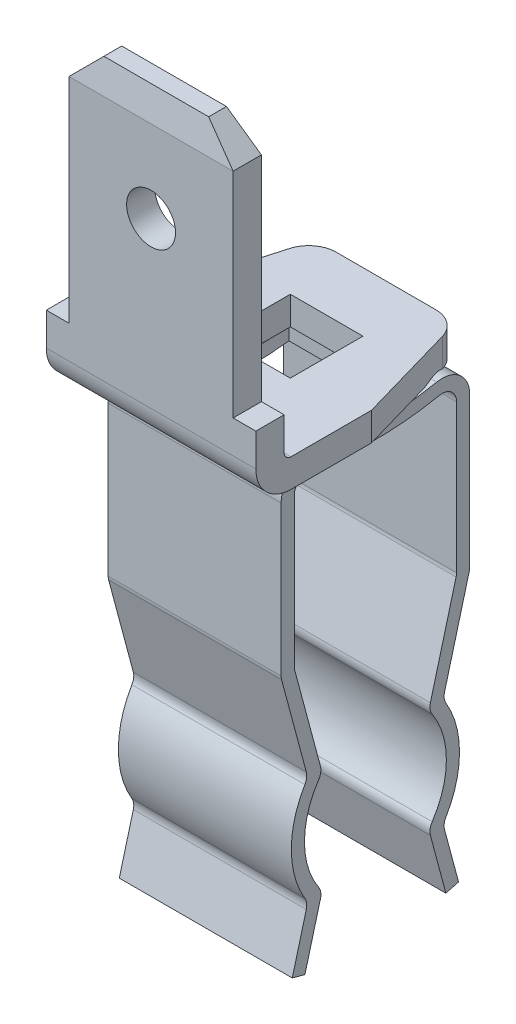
ISO-10303-21;
HEADER;
FILE_DESCRIPTION(('STEP AP214'),'2;1');
FILE_NAME('part.step','',(''),(''),'','','');
FILE_SCHEMA(('AUTOMOTIVE_DESIGN { 1 0 10303 214 1 1 1 1 }'));
ENDSEC;
DATA;
#1=APPLICATION_CONTEXT('core data for automotive mechanical design processes');
#2=APPLICATION_PROTOCOL_DEFINITION('international standard','automotive_design',2000,#1);
#3=PRODUCT_CONTEXT('',#1,'mechanical');
#4=PRODUCT('Part','Part','',(#3));
#5=PRODUCT_RELATED_PRODUCT_CATEGORY('part','',(#4));
#6=PRODUCT_DEFINITION_FORMATION('','',#4);
#7=PRODUCT_DEFINITION_CONTEXT('part definition',#1,'design');
#8=PRODUCT_DEFINITION('design','',#6,#7);
#9=PRODUCT_DEFINITION_SHAPE('','',#8);
#10=(LENGTH_UNIT() NAMED_UNIT(*) SI_UNIT(.MILLI.,.METRE.));
#11=(NAMED_UNIT(*) PLANE_ANGLE_UNIT() SI_UNIT($,.RADIAN.));
#12=(NAMED_UNIT(*) SI_UNIT($,.STERADIAN.) SOLID_ANGLE_UNIT());
#13=UNCERTAINTY_MEASURE_WITH_UNIT(LENGTH_MEASURE(1.E-05),#10,'distance_accuracy_value','');
#14=(GEOMETRIC_REPRESENTATION_CONTEXT(3) GLOBAL_UNCERTAINTY_ASSIGNED_CONTEXT((#13)) GLOBAL_UNIT_ASSIGNED_CONTEXT((#10,
#11,#12)) REPRESENTATION_CONTEXT('',''));
#15=CARTESIAN_POINT('',(0.,0.,0.));
#16=DIRECTION('',(0.,0.,1.));
#17=DIRECTION('',(1.,0.,0.));
#18=AXIS2_PLACEMENT_3D('',#15,#16,#17);
#19=CARTESIAN_POINT('',(-9.9965,9.121795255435,11.02129570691));
#20=DIRECTION('',(0.,-0.965925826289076,0.258819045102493));
#21=DIRECTION('',(0.,-0.258819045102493,-0.965925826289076));
#22=AXIS2_PLACEMENT_3D('',#19,#20,#21);
#23=PLANE('',#22);
#24=DIRECTION('',(1.,0.,0.));
#25=VECTOR('',#24,1.);
#26=CARTESIAN_POINT('',(-9.9965,9.12179525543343,11.0212957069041));
#27=LINE('',#26,#25);
#28=CARTESIAN_POINT('',(-9.9965,9.12179525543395,11.0212957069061));
#29=VERTEX_POINT('',#28);
#30=CARTESIAN_POINT('',(-5.0435,9.12179525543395,11.0212957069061));
#31=VERTEX_POINT('',#30);
#32=EDGE_CURVE('E673',#29,#31,#27,.T.);
#33=ORIENTED_EDGE('',*,*,#32,.F.);
#34=DIRECTION('',(0.,-0.258819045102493,-0.965925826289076));
#35=VECTOR('',#34,1.);
#36=CARTESIAN_POINT('',(-9.9965,9.121795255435,11.02129570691));
#37=LINE('',#36,#35);
#38=CARTESIAN_POINT('',(-9.9965,9.0244999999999,10.65818487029));
#39=VERTEX_POINT('',#38);
#40=EDGE_CURVE('E691',#29,#39,#37,.T.);
#41=ORIENTED_EDGE('',*,*,#40,.T.);
#42=DIRECTION('',(1.,0.,0.));
#43=VECTOR('',#42,1.);
#44=CARTESIAN_POINT('',(-9.9965,9.0245,10.65818487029));
#45=LINE('',#44,#43);
#46=CARTESIAN_POINT('',(-5.0435,9.0244999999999,10.65818487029));
#47=VERTEX_POINT('',#46);
#48=EDGE_CURVE('E659',#47,#39,#45,.F.);
#49=ORIENTED_EDGE('',*,*,#48,.F.);
#50=DIRECTION('',(0.,-0.258819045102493,-0.965925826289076));
#51=VECTOR('',#50,1.);
#52=CARTESIAN_POINT('',(-5.0435,9.121795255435,11.02129570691));
#53=LINE('',#52,#51);
#54=EDGE_CURVE('E703',#47,#31,#53,.F.);
#55=ORIENTED_EDGE('',*,*,#54,.T.);
#56=EDGE_LOOP('',(#33,#41,#49,#55));
#57=FACE_BOUND('',#56,.T.);
#58=ADVANCED_FACE('F16',(#57),#23,.T.);
#59=CARTESIAN_POINT('',(-9.9965,9.0245,6.621815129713));
#60=DIRECTION('',(0.,-0.965925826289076,-0.258819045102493));
#61=DIRECTION('',(0.,0.258819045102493,-0.965925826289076));
#62=AXIS2_PLACEMENT_3D('',#59,#60,#61);
#63=PLANE('',#62);
#64=DIRECTION('',(1.,0.,0.));
#65=VECTOR('',#64,1.);
#66=CARTESIAN_POINT('',(-9.9965,9.02450000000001,6.62181512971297));
#67=LINE('',#66,#65);
#68=CARTESIAN_POINT('',(-9.9965,9.02450000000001,6.62181512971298));
#69=VERTEX_POINT('',#68);
#70=CARTESIAN_POINT('',(-5.0435,9.02450000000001,6.62181512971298));
#71=VERTEX_POINT('',#70);
#72=EDGE_CURVE('E645',#69,#71,#67,.T.);
#73=ORIENTED_EDGE('',*,*,#72,.F.);
#74=DIRECTION('',(0.,0.258819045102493,-0.965925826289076));
#75=VECTOR('',#74,1.);
#76=CARTESIAN_POINT('',(-9.9965,9.0245,6.621815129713));
#77=LINE('',#76,#75);
#78=CARTESIAN_POINT('',(-9.9965,9.12179525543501,6.258704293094));
#79=VERTEX_POINT('',#78);
#80=EDGE_CURVE('E679',#69,#79,#77,.T.);
#81=ORIENTED_EDGE('',*,*,#80,.T.);
#82=DIRECTION('',(1.,0.,0.));
#83=VECTOR('',#82,1.);
#84=CARTESIAN_POINT('',(-9.9965,9.121795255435,6.258704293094));
#85=LINE('',#84,#83);
#86=CARTESIAN_POINT('',(-5.0435,9.12179525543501,6.258704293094));
#87=VERTEX_POINT('',#86);
#88=EDGE_CURVE('E630',#87,#79,#85,.F.);
#89=ORIENTED_EDGE('',*,*,#88,.F.);
#90=DIRECTION('',(0.,0.258819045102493,-0.965925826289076));
#91=VECTOR('',#90,1.);
#92=CARTESIAN_POINT('',(-5.0435,9.0245,6.621815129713));
#93=LINE('',#92,#91);
#94=EDGE_CURVE('E687',#87,#71,#93,.F.);
#95=ORIENTED_EDGE('',*,*,#94,.T.);
#96=EDGE_LOOP('',(#73,#81,#89,#95));
#97=FACE_BOUND('',#96,.T.);
#98=ADVANCED_FACE('F1388',(#97),#63,.T.);
#99=CARTESIAN_POINT('',(-9.9965,10.78244212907,10.5763267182));
#100=DIRECTION('',(0.,0.258819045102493,0.965925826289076));
#101=DIRECTION('',(0.,-0.965925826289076,0.258819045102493));
#102=AXIS2_PLACEMENT_3D('',#99,#100,#101);
#103=PLANE('',#102);
#104=DIRECTION('',(0.,-0.965925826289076,0.258819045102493));
#105=VECTOR('',#104,1.);
#106=CARTESIAN_POINT('',(-5.0435,10.78244212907,10.5763267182));
#107=LINE('',#106,#105);
#108=CARTESIAN_POINT('',(-5.0435,10.6212990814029,10.6195048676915));
#109=VERTEX_POINT('',#108);
#110=EDGE_CURVE('E665',#31,#109,#107,.F.);
#111=ORIENTED_EDGE('',*,*,#110,.T.);
#112=DIRECTION('',(-1.,0.,0.));
#113=VECTOR('',#112,1.);
#114=CARTESIAN_POINT('',(-10.01696114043,10.6212990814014,10.6195048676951));
#115=LINE('',#114,#113);
#116=CARTESIAN_POINT('',(-9.9965,10.6212990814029,10.6195048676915));
#117=VERTEX_POINT('',#116);
#118=EDGE_CURVE('E668',#109,#117,#115,.T.);
#119=ORIENTED_EDGE('',*,*,#118,.T.);
#120=DIRECTION('',(0.,-0.965925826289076,0.258819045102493));
#121=VECTOR('',#120,1.);
#122=CARTESIAN_POINT('',(-9.9965,10.78244212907,10.5763267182));
#123=LINE('',#122,#121);
#124=EDGE_CURVE('E676',#117,#29,#123,.T.);
#125=ORIENTED_EDGE('',*,*,#124,.T.);
#126=ORIENTED_EDGE('',*,*,#32,.T.);
#127=EDGE_LOOP('',(#111,#119,#125,#126));
#128=FACE_BOUND('',#127,.T.);
#129=ADVANCED_FACE('F1128',(#128),#103,.T.);
#130=CARTESIAN_POINT('',(-9.9965,9.0245,10.65818487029));
#131=DIRECTION('',(0.,-0.258819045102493,-0.965925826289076));
#132=DIRECTION('',(0.,0.965925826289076,-0.258819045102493));
#133=AXIS2_PLACEMENT_3D('',#130,#131,#132);
#134=PLANE('',#133);
#135=DIRECTION('',(0.,0.965925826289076,-0.258819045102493));
#136=VECTOR('',#135,1.);
#137=CARTESIAN_POINT('',(-9.9965,9.0245,10.65818487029));
#138=LINE('',#137,#136);
#139=CARTESIAN_POINT('',(-9.9965,10.6829135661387,10.2138142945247));
#140=VERTEX_POINT('',#139);
#141=EDGE_CURVE('E646',#39,#140,#138,.T.);
#142=ORIENTED_EDGE('',*,*,#141,.T.);
#143=DIRECTION('',(1.,0.,0.));
#144=VECTOR('',#143,1.);
#145=CARTESIAN_POINT('',(-5.019553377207,10.6829135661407,10.2138142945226));
#146=LINE('',#145,#144);
#147=CARTESIAN_POINT('',(-5.0435,10.6829135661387,10.2138142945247));
#148=VERTEX_POINT('',#147);
#149=EDGE_CURVE('E653',#148,#140,#146,.F.);
#150=ORIENTED_EDGE('',*,*,#149,.F.);
#151=DIRECTION('',(0.,0.965925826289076,-0.258819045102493));
#152=VECTOR('',#151,1.);
#153=CARTESIAN_POINT('',(-5.0435,9.0245,10.65818487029));
#154=LINE('',#153,#152);
#155=EDGE_CURVE('E662',#148,#47,#154,.F.);
#156=ORIENTED_EDGE('',*,*,#155,.T.);
#157=ORIENTED_EDGE('',*,*,#48,.T.);
#158=EDGE_LOOP('',(#142,#150,#156,#157));
#159=FACE_BOUND('',#158,.T.);
#160=ADVANCED_FACE('F1133',(#159),#134,.T.);
#161=CARTESIAN_POINT('',(-9.9965,10.85791506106,7.113077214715));
#162=DIRECTION('',(0.,-0.258819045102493,0.965925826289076));
#163=DIRECTION('',(0.,-0.965925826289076,-0.258819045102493));
#164=AXIS2_PLACEMENT_3D('',#161,#162,#163);
#165=PLANE('',#164);
#166=DIRECTION('',(0.,-0.965925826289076,-0.258819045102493));
#167=VECTOR('',#166,1.);
#168=CARTESIAN_POINT('',(-5.0435,10.85791506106,7.113077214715));
#169=LINE('',#168,#167);
#170=CARTESIAN_POINT('',(-5.0435,10.6829135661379,7.06618570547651));
#171=VERTEX_POINT('',#170);
#172=EDGE_CURVE('E631',#71,#171,#169,.F.);
#173=ORIENTED_EDGE('',*,*,#172,.T.);
#174=DIRECTION('',(1.,0.,0.));
#175=VECTOR('',#174,1.);
#176=CARTESIAN_POINT('',(-5.019553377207,10.6829135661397,7.06618570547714));
#177=LINE('',#176,#175);
#178=CARTESIAN_POINT('',(-9.9965,10.6829135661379,7.06618570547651));
#179=VERTEX_POINT('',#178);
#180=EDGE_CURVE('E638',#179,#171,#177,.T.);
#181=ORIENTED_EDGE('',*,*,#180,.F.);
#182=DIRECTION('',(0.,-0.965925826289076,-0.258819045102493));
#183=VECTOR('',#182,1.);
#184=CARTESIAN_POINT('',(-9.9965,10.85791506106,7.113077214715));
#185=LINE('',#184,#183);
#186=EDGE_CURVE('E642',#179,#69,#185,.T.);
#187=ORIENTED_EDGE('',*,*,#186,.T.);
#188=ORIENTED_EDGE('',*,*,#72,.T.);
#189=EDGE_LOOP('',(#173,#181,#187,#188));
#190=FACE_BOUND('',#189,.T.);
#191=ADVANCED_FACE('F1384',(#190),#165,.T.);
#192=CARTESIAN_POINT('',(-9.9965,9.121795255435,6.258704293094));
#193=DIRECTION('',(0.,0.258819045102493,-0.965925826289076));
#194=DIRECTION('',(0.,0.965925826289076,0.258819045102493));
#195=AXIS2_PLACEMENT_3D('',#192,#193,#194);
#196=PLANE('',#195);
#197=DIRECTION('',(0.,0.965925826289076,0.258819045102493));
#198=VECTOR('',#197,1.);
#199=CARTESIAN_POINT('',(-9.9965,9.121795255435,6.258704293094));
#200=LINE('',#199,#198);
#201=CARTESIAN_POINT('',(-9.9965,10.6212990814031,6.66049513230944));
#202=VERTEX_POINT('',#201);
#203=EDGE_CURVE('E437',#79,#202,#200,.T.);
#204=ORIENTED_EDGE('',*,*,#203,.T.);
#205=DIRECTION('',(-1.,0.,0.));
#206=VECTOR('',#205,1.);
#207=CARTESIAN_POINT('',(-10.01696114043,10.6212990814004,6.66049513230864));
#208=LINE('',#207,#206);
#209=CARTESIAN_POINT('',(-5.0435,10.6212990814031,6.66049513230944));
#210=VERTEX_POINT('',#209);
#211=EDGE_CURVE('E622',#202,#210,#208,.F.);
#212=ORIENTED_EDGE('',*,*,#211,.T.);
#213=DIRECTION('',(0.,0.965925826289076,0.258819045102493));
#214=VECTOR('',#213,1.);
#215=CARTESIAN_POINT('',(-5.0435,9.121795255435,6.258704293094));
#216=LINE('',#215,#214);
#217=EDGE_CURVE('E627',#210,#87,#216,.F.);
#218=ORIENTED_EDGE('',*,*,#217,.T.);
#219=ORIENTED_EDGE('',*,*,#88,.T.);
#220=EDGE_LOOP('',(#204,#212,#218,#219));
#221=FACE_BOUND('',#220,.T.);
#222=ADVANCED_FACE('F1391',(#221),#196,.T.);
#223=CARTESIAN_POINT('',(-10.01696114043,13.93309086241,10.98752260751));
#224=DIRECTION('',(-1.,0.,0.));
#225=DIRECTION('',(0.,0.,1.));
#226=AXIS2_PLACEMENT_3D('',#223,#224,#225);
#227=CYLINDRICAL_SURFACE('',#226,0.381);
#228=DIRECTION('',(1.,0.,0.));
#229=VECTOR('',#228,1.);
#230=CARTESIAN_POINT('',(-9.9965,14.0317009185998,10.6195048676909));
#231=LINE('',#230,#229);
#232=CARTESIAN_POINT('',(-9.9965,14.0317009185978,10.6195048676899));
#233=VERTEX_POINT('',#232);
#234=CARTESIAN_POINT('',(-5.0435,14.0317009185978,10.6195048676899));
#235=VERTEX_POINT('',#234);
#236=EDGE_CURVE('E439',#233,#235,#231,.T.);
#237=ORIENTED_EDGE('',*,*,#236,.F.);
#238=CARTESIAN_POINT('',(-9.9965,13.93309086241,10.98752260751));
#239=DIRECTION('',(-1.,0.,0.));
#240=DIRECTION('',(0.,0.,1.));
#241=AXIS2_PLACEMENT_3D('',#238,#239,#240);
#242=CIRCLE('',#241,0.381);
#243=CARTESIAN_POINT('',(-9.9965,13.7384312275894,10.660003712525));
#244=VERTEX_POINT('',#243);
#245=EDGE_CURVE('E19',#244,#233,#242,.F.);
#246=ORIENTED_EDGE('',*,*,#245,.F.);
#247=DIRECTION('',(-1.,0.,0.));
#248=VECTOR('',#247,1.);
#249=CARTESIAN_POINT('',(-9.9965,13.7384312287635,10.6600037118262));
#250=LINE('',#249,#248);
#251=CARTESIAN_POINT('',(-5.0435,13.7384312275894,10.660003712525));
#252=VERTEX_POINT('',#251);
#253=EDGE_CURVE('E600',#252,#244,#250,.T.);
#254=ORIENTED_EDGE('',*,*,#253,.F.);
#255=CARTESIAN_POINT('',(-5.0435,13.93309086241,10.98752260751));
#256=DIRECTION('',(-1.,0.,0.));
#257=DIRECTION('',(0.,0.,1.));
#258=AXIS2_PLACEMENT_3D('',#255,#256,#257);
#259=CIRCLE('',#258,0.381);
#260=EDGE_CURVE('E436',#235,#252,#259,.T.);
#261=ORIENTED_EDGE('',*,*,#260,.F.);
#262=EDGE_LOOP('',(#237,#246,#254,#261));
#263=FACE_BOUND('',#262,.T.);
#264=ADVANCED_FACE('F440',(#263),#227,.F.);
#265=CARTESIAN_POINT('',(-10.01696114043,10.71990913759,10.98752260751));
#266=DIRECTION('',(-1.,0.,0.));
#267=DIRECTION('',(0.,0.,1.));
#268=AXIS2_PLACEMENT_3D('',#265,#266,#267);
#269=CYLINDRICAL_SURFACE('',#268,0.381);
#270=DIRECTION('',(-1.,0.,0.));
#271=VECTOR('',#270,1.);
#272=CARTESIAN_POINT('',(-9.9965,10.9145687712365,10.6600037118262));
#273=LINE('',#272,#271);
#274=CARTESIAN_POINT('',(-9.9965,10.9145687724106,10.660003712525));
#275=VERTEX_POINT('',#274);
#276=CARTESIAN_POINT('',(-5.0435,10.9145687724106,10.660003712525));
#277=VERTEX_POINT('',#276);
#278=EDGE_CURVE('E595',#275,#277,#273,.F.);
#279=ORIENTED_EDGE('',*,*,#278,.F.);
#280=CARTESIAN_POINT('',(-9.9965,10.71990913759,10.98752260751));
#281=DIRECTION('',(-1.,0.,0.));
#282=DIRECTION('',(0.,0.,1.));
#283=AXIS2_PLACEMENT_3D('',#280,#281,#282);
#284=CIRCLE('',#283,0.381);
#285=EDGE_CURVE('E671',#117,#275,#284,.F.);
#286=ORIENTED_EDGE('',*,*,#285,.F.);
#287=ORIENTED_EDGE('',*,*,#118,.F.);
#288=CARTESIAN_POINT('',(-5.0435,10.71990913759,10.98752260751));
#289=DIRECTION('',(-1.,0.,0.));
#290=DIRECTION('',(0.,0.,1.));
#291=AXIS2_PLACEMENT_3D('',#288,#289,#290);
#292=CIRCLE('',#291,0.381);
#293=EDGE_CURVE('E1115',#277,#109,#292,.T.);
#294=ORIENTED_EDGE('',*,*,#293,.F.);
#295=EDGE_LOOP('',(#279,#286,#287,#294));
#296=FACE_BOUND('',#295,.T.);
#297=ADVANCED_FACE('F1122',(#296),#269,.F.);
#298=CARTESIAN_POINT('',(-5.019553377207,10.78152362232,10.58183203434));
#299=DIRECTION('',(1.,0.,0.));
#300=DIRECTION('',(0.,0.,-1.));
#301=AXIS2_PLACEMENT_3D('',#298,#299,#300);
#302=CYLINDRICAL_SURFACE('',#301,0.381);
#303=CARTESIAN_POINT('',(-9.9965,10.78152362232,10.58183203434));
#304=DIRECTION('',(1.,0.,0.));
#305=DIRECTION('',(0.,0.,-1.));
#306=AXIS2_PLACEMENT_3D('',#303,#304,#305);
#307=CIRCLE('',#306,0.381);
#308=CARTESIAN_POINT('',(-9.9965,10.9941350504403,10.2656716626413));
#309=VERTEX_POINT('',#308);
#310=EDGE_CURVE('E656',#140,#309,#307,.T.);
#311=ORIENTED_EDGE('',*,*,#310,.T.);
#312=DIRECTION('',(-1.,0.,0.));
#313=VECTOR('',#312,1.);
#314=CARTESIAN_POINT('',(-9.9965,10.9941350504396,10.2656716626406));
#315=LINE('',#314,#313);
#316=CARTESIAN_POINT('',(-5.0435,10.9941350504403,10.2656716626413));
#317=VERTEX_POINT('',#316);
#318=EDGE_CURVE('E592',#309,#317,#315,.F.);
#319=ORIENTED_EDGE('',*,*,#318,.T.);
#320=CARTESIAN_POINT('',(-5.0435,10.78152362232,10.58183203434));
#321=DIRECTION('',(1.,0.,0.));
#322=DIRECTION('',(0.,0.,-1.));
#323=AXIS2_PLACEMENT_3D('',#320,#321,#322);
#324=CIRCLE('',#323,0.381);
#325=EDGE_CURVE('E657',#317,#148,#324,.F.);
#326=ORIENTED_EDGE('',*,*,#325,.T.);
#327=ORIENTED_EDGE('',*,*,#149,.T.);
#328=EDGE_LOOP('',(#311,#319,#326,#327));
#329=FACE_BOUND('',#328,.T.);
#330=ADVANCED_FACE('F1137',(#329),#302,.T.);
#331=CARTESIAN_POINT('',(-5.019553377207,13.87147637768,10.58183203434));
#332=DIRECTION('',(1.,0.,0.));
#333=DIRECTION('',(0.,0.,-1.));
#334=AXIS2_PLACEMENT_3D('',#331,#332,#333);
#335=CYLINDRICAL_SURFACE('',#334,0.381);
#336=CARTESIAN_POINT('',(-9.9965,13.87147637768,10.58183203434));
#337=DIRECTION('',(1.,0.,0.));
#338=DIRECTION('',(0.,0.,-1.));
#339=AXIS2_PLACEMENT_3D('',#336,#337,#338);
#340=CIRCLE('',#339,0.381);
#341=CARTESIAN_POINT('',(-9.9965,13.6588649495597,10.2656716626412));
#342=VERTEX_POINT('',#341);
#343=CARTESIAN_POINT('',(-9.9965,13.970086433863,10.2138142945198));
#344=VERTEX_POINT('',#343);
#345=EDGE_CURVE('E1094',#342,#344,#340,.T.);
#346=ORIENTED_EDGE('',*,*,#345,.T.);
#347=DIRECTION('',(1.,0.,0.));
#348=VECTOR('',#347,1.);
#349=CARTESIAN_POINT('',(-9.9965,13.9700864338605,10.2138142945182));
#350=LINE('',#349,#348);
#351=CARTESIAN_POINT('',(-5.0435,13.970086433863,10.2138142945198));
#352=VERTEX_POINT('',#351);
#353=EDGE_CURVE('E585',#352,#344,#350,.F.);
#354=ORIENTED_EDGE('',*,*,#353,.F.);
#355=CARTESIAN_POINT('',(-5.0435,13.87147637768,10.58183203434));
#356=DIRECTION('',(1.,0.,0.));
#357=DIRECTION('',(0.,0.,-1.));
#358=AXIS2_PLACEMENT_3D('',#355,#356,#357);
#359=CIRCLE('',#358,0.381);
#360=CARTESIAN_POINT('',(-5.0435,13.6588649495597,10.2656716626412));
#361=VERTEX_POINT('',#360);
#362=EDGE_CURVE('E1110',#352,#361,#359,.F.);
#363=ORIENTED_EDGE('',*,*,#362,.T.);
#364=DIRECTION('',(-1.,0.,0.));
#365=VECTOR('',#364,1.);
#366=CARTESIAN_POINT('',(-9.9965,13.6588649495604,10.2656716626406));
#367=LINE('',#366,#365);
#368=EDGE_CURVE('E591',#361,#342,#367,.T.);
#369=ORIENTED_EDGE('',*,*,#368,.T.);
#370=EDGE_LOOP('',(#346,#354,#363,#369));
#371=FACE_BOUND('',#370,.T.);
#372=ADVANCED_FACE('F1141',(#371),#335,.T.);
#373=CARTESIAN_POINT('',(-10.01696114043,16.82035040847,10.5831));
#374=DIRECTION('',(-1.,0.,0.));
#375=DIRECTION('',(0.,0.,1.));
#376=AXIS2_PLACEMENT_3D('',#373,#374,#375);
#377=CYLINDRICAL_SURFACE('',#376,0.381);
#378=DIRECTION('',(1.,0.,0.));
#379=VECTOR('',#378,1.);
#380=CARTESIAN_POINT('',(-9.9965,16.7217403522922,10.9511177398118));
#381=LINE('',#380,#379);
#382=CARTESIAN_POINT('',(-9.9965,16.7217403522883,10.9511177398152));
#383=VERTEX_POINT('',#382);
#384=CARTESIAN_POINT('',(-5.0435,16.7217403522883,10.9511177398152));
#385=VERTEX_POINT('',#384);
#386=EDGE_CURVE('E588',#383,#385,#381,.T.);
#387=ORIENTED_EDGE('',*,*,#386,.F.);
#388=CARTESIAN_POINT('',(-9.9965,16.82035040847,10.5831));
#389=DIRECTION('',(-1.,0.,0.));
#390=DIRECTION('',(0.,0.,1.));
#391=AXIS2_PLACEMENT_3D('',#388,#389,#390);
#392=CIRCLE('',#391,0.381);
#393=CARTESIAN_POINT('',(-9.9965,16.82035040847,10.9641));
#394=VERTEX_POINT('',#393);
#395=EDGE_CURVE('E1095',#394,#383,#392,.F.);
#396=ORIENTED_EDGE('',*,*,#395,.F.);
#397=DIRECTION('',(-1.,0.,0.));
#398=VECTOR('',#397,1.);
#399=CARTESIAN_POINT('',(-9.9965,16.82035040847,10.9641));
#400=LINE('',#399,#398);
#401=CARTESIAN_POINT('',(-5.0435,16.82035040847,10.9641));
#402=VERTEX_POINT('',#401);
#403=EDGE_CURVE('E572',#402,#394,#400,.T.);
#404=ORIENTED_EDGE('',*,*,#403,.F.);
#405=CARTESIAN_POINT('',(-5.0435,16.82035040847,10.5831));
#406=DIRECTION('',(-1.,0.,0.));
#407=DIRECTION('',(0.,0.,1.));
#408=AXIS2_PLACEMENT_3D('',#405,#406,#407);
#409=CIRCLE('',#408,0.381);
#410=EDGE_CURVE('E1098',#385,#402,#409,.T.);
#411=ORIENTED_EDGE('',*,*,#410,.F.);
#412=EDGE_LOOP('',(#387,#396,#404,#411));
#413=FACE_BOUND('',#412,.T.);
#414=ADVANCED_FACE('F1100',(#413),#377,.F.);
#415=CARTESIAN_POINT('',(-10.01696114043,16.82035040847,6.6969));
#416=DIRECTION('',(-1.,0.,0.));
#417=DIRECTION('',(0.,0.,1.));
#418=AXIS2_PLACEMENT_3D('',#415,#416,#417);
#419=CYLINDRICAL_SURFACE('',#418,0.381);
#420=DIRECTION('',(1.,0.,0.));
#421=VECTOR('',#420,1.);
#422=CARTESIAN_POINT('',(-9.9965,16.82035040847,6.3159));
#423=LINE('',#422,#421);
#424=CARTESIAN_POINT('',(-9.9965,16.82035040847,6.3159));
#425=VERTEX_POINT('',#424);
#426=CARTESIAN_POINT('',(-5.0435,16.82035040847,6.3159));
#427=VERTEX_POINT('',#426);
#428=EDGE_CURVE('E566',#425,#427,#423,.T.);
#429=ORIENTED_EDGE('',*,*,#428,.F.);
#430=CARTESIAN_POINT('',(-9.9965,16.82035040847,6.6969));
#431=DIRECTION('',(-1.,0.,0.));
#432=DIRECTION('',(0.,0.,1.));
#433=AXIS2_PLACEMENT_3D('',#430,#431,#432);
#434=CIRCLE('',#433,0.381);
#435=CARTESIAN_POINT('',(-9.9965,16.7217403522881,6.32888226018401));
#436=VERTEX_POINT('',#435);
#437=EDGE_CURVE('E1103',#436,#425,#434,.F.);
#438=ORIENTED_EDGE('',*,*,#437,.F.);
#439=DIRECTION('',(1.,0.,0.));
#440=VECTOR('',#439,1.);
#441=CARTESIAN_POINT('',(-9.9965,16.7217403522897,6.32888226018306));
#442=LINE('',#441,#440);
#443=CARTESIAN_POINT('',(-5.0435,16.7217403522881,6.32888226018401));
#444=VERTEX_POINT('',#443);
#445=EDGE_CURVE('E563',#444,#436,#442,.F.);
#446=ORIENTED_EDGE('',*,*,#445,.F.);
#447=CARTESIAN_POINT('',(-5.0435,16.82035040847,6.6969));
#448=DIRECTION('',(-1.,0.,0.));
#449=DIRECTION('',(0.,0.,1.));
#450=AXIS2_PLACEMENT_3D('',#447,#448,#449);
#451=CIRCLE('',#450,0.381);
#452=EDGE_CURVE('E1105',#427,#444,#451,.T.);
#453=ORIENTED_EDGE('',*,*,#452,.F.);
#454=EDGE_LOOP('',(#429,#438,#446,#453));
#455=FACE_BOUND('',#454,.T.);
#456=ADVANCED_FACE('F1370',(#455),#419,.F.);
#457=CARTESIAN_POINT('',(-5.019553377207,13.87147637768,6.69816796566));
#458=DIRECTION('',(1.,0.,0.));
#459=DIRECTION('',(0.,0.,-1.));
#460=AXIS2_PLACEMENT_3D('',#457,#458,#459);
#461=CYLINDRICAL_SURFACE('',#460,0.381);
#462=CARTESIAN_POINT('',(-9.9965,13.87147637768,6.69816796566));
#463=DIRECTION('',(1.,0.,0.));
#464=DIRECTION('',(0.,0.,-1.));
#465=AXIS2_PLACEMENT_3D('',#462,#463,#464);
#466=CIRCLE('',#465,0.381);
#467=CARTESIAN_POINT('',(-9.9965,13.9700864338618,7.06618570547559));
#468=VERTEX_POINT('',#467);
#469=CARTESIAN_POINT('',(-9.9965,13.6588649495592,7.01432833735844));
#470=VERTEX_POINT('',#469);
#471=EDGE_CURVE('E1362',#468,#470,#466,.T.);
#472=ORIENTED_EDGE('',*,*,#471,.T.);
#473=DIRECTION('',(-1.,0.,0.));
#474=VECTOR('',#473,1.);
#475=CARTESIAN_POINT('',(-9.9965,13.6588649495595,7.01432833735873));
#476=LINE('',#475,#474);
#477=CARTESIAN_POINT('',(-5.0435,13.6588649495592,7.01432833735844));
#478=VERTEX_POINT('',#477);
#479=EDGE_CURVE('E557',#470,#478,#476,.F.);
#480=ORIENTED_EDGE('',*,*,#479,.T.);
#481=CARTESIAN_POINT('',(-5.0435,13.87147637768,6.69816796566));
#482=DIRECTION('',(1.,0.,0.));
#483=DIRECTION('',(0.,0.,-1.));
#484=AXIS2_PLACEMENT_3D('',#481,#482,#483);
#485=CIRCLE('',#484,0.381);
#486=CARTESIAN_POINT('',(-5.0435,13.9700864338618,7.06618570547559));
#487=VERTEX_POINT('',#486);
#488=EDGE_CURVE('E1364',#478,#487,#485,.F.);
#489=ORIENTED_EDGE('',*,*,#488,.T.);
#490=DIRECTION('',(1.,0.,0.));
#491=VECTOR('',#490,1.);
#492=CARTESIAN_POINT('',(-9.9965,13.97008643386,7.06618570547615));
#493=LINE('',#492,#491);
#494=EDGE_CURVE('E560',#468,#487,#493,.T.);
#495=ORIENTED_EDGE('',*,*,#494,.F.);
#496=EDGE_LOOP('',(#472,#480,#489,#495));
#497=FACE_BOUND('',#496,.T.);
#498=ADVANCED_FACE('F1374',(#497),#461,.T.);
#499=CARTESIAN_POINT('',(-5.019553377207,10.78152362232,6.69816796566));
#500=DIRECTION('',(1.,0.,0.));
#501=DIRECTION('',(0.,0.,-1.));
#502=AXIS2_PLACEMENT_3D('',#499,#500,#501);
#503=CYLINDRICAL_SURFACE('',#502,0.381);
#504=CARTESIAN_POINT('',(-9.9965,10.78152362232,6.69816796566));
#505=DIRECTION('',(1.,0.,0.));
#506=DIRECTION('',(0.,0.,-1.));
#507=AXIS2_PLACEMENT_3D('',#504,#505,#506);
#508=CIRCLE('',#507,0.381);
#509=CARTESIAN_POINT('',(-9.9965,10.9941350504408,7.01432833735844));
#510=VERTEX_POINT('',#509);
#511=EDGE_CURVE('E641',#510,#179,#508,.T.);
#512=ORIENTED_EDGE('',*,*,#511,.T.);
#513=ORIENTED_EDGE('',*,*,#180,.T.);
#514=CARTESIAN_POINT('',(-5.0435,10.78152362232,6.69816796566));
#515=DIRECTION('',(1.,0.,0.));
#516=DIRECTION('',(0.,0.,-1.));
#517=AXIS2_PLACEMENT_3D('',#514,#515,#516);
#518=CIRCLE('',#517,0.381);
#519=CARTESIAN_POINT('',(-5.0435,10.9941350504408,7.01432833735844));
#520=VERTEX_POINT('',#519);
#521=EDGE_CURVE('E1360',#171,#520,#518,.F.);
#522=ORIENTED_EDGE('',*,*,#521,.T.);
#523=DIRECTION('',(-1.,0.,0.));
#524=VECTOR('',#523,1.);
#525=CARTESIAN_POINT('',(-9.9965,10.9941350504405,7.01432833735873));
#526=LINE('',#525,#524);
#527=EDGE_CURVE('E556',#520,#510,#526,.T.);
#528=ORIENTED_EDGE('',*,*,#527,.T.);
#529=EDGE_LOOP('',(#512,#513,#522,#528));
#530=FACE_BOUND('',#529,.T.);
#531=ADVANCED_FACE('F1381',(#530),#503,.T.);
#532=CARTESIAN_POINT('',(-10.01696114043,10.71990913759,6.292477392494));
#533=DIRECTION('',(-1.,0.,0.));
#534=DIRECTION('',(0.,0.,1.));
#535=AXIS2_PLACEMENT_3D('',#532,#533,#534);
#536=CYLINDRICAL_SURFACE('',#535,0.381);
#537=ORIENTED_EDGE('',*,*,#211,.F.);
#538=CARTESIAN_POINT('',(-9.9965,10.71990913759,6.292477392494));
#539=DIRECTION('',(-1.,0.,0.));
#540=DIRECTION('',(0.,0.,1.));
#541=AXIS2_PLACEMENT_3D('',#538,#539,#540);
#542=CIRCLE('',#541,0.381);
#543=CARTESIAN_POINT('',(-9.9965,10.9145687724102,6.61999628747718));
#544=VERTEX_POINT('',#543);
#545=EDGE_CURVE('E626',#544,#202,#542,.F.);
#546=ORIENTED_EDGE('',*,*,#545,.F.);
#547=DIRECTION('',(-1.,0.,0.));
#548=VECTOR('',#547,1.);
#549=CARTESIAN_POINT('',(-9.9965,10.9145687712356,6.61999628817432));
#550=LINE('',#549,#548);
#551=CARTESIAN_POINT('',(-5.0435,10.9145687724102,6.61999628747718));
#552=VERTEX_POINT('',#551);
#553=EDGE_CURVE('E553',#552,#544,#550,.T.);
#554=ORIENTED_EDGE('',*,*,#553,.F.);
#555=CARTESIAN_POINT('',(-5.0435,10.71990913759,6.292477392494));
#556=DIRECTION('',(-1.,0.,0.));
#557=DIRECTION('',(0.,0.,1.));
#558=AXIS2_PLACEMENT_3D('',#555,#556,#557);
#559=CIRCLE('',#558,0.381);
#560=EDGE_CURVE('E625',#210,#552,#559,.T.);
#561=ORIENTED_EDGE('',*,*,#560,.F.);
#562=EDGE_LOOP('',(#537,#546,#554,#561));
#563=FACE_BOUND('',#562,.T.);
#564=ADVANCED_FACE('F1396',(#563),#536,.F.);
#565=CARTESIAN_POINT('',(-10.01696114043,13.93309086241,6.292477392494));
#566=DIRECTION('',(-1.,0.,0.));
#567=DIRECTION('',(0.,0.,1.));
#568=AXIS2_PLACEMENT_3D('',#565,#566,#567);
#569=CYLINDRICAL_SURFACE('',#568,0.381);
#570=DIRECTION('',(-1.,0.,0.));
#571=VECTOR('',#570,1.);
#572=CARTESIAN_POINT('',(-9.9965,13.7384312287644,6.61999628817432));
#573=LINE('',#572,#571);
#574=CARTESIAN_POINT('',(-9.9965,13.7384312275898,6.61999628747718));
#575=VERTEX_POINT('',#574);
#576=CARTESIAN_POINT('',(-5.0435,13.7384312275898,6.61999628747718));
#577=VERTEX_POINT('',#576);
#578=EDGE_CURVE('E548',#575,#577,#573,.F.);
#579=ORIENTED_EDGE('',*,*,#578,.F.);
#580=CARTESIAN_POINT('',(-9.9965,13.93309086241,6.292477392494));
#581=DIRECTION('',(-1.,0.,0.));
#582=DIRECTION('',(0.,0.,1.));
#583=AXIS2_PLACEMENT_3D('',#580,#581,#582);
#584=CIRCLE('',#583,0.381);
#585=CARTESIAN_POINT('',(-9.9965,14.0317009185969,6.66049513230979));
#586=VERTEX_POINT('',#585);
#587=EDGE_CURVE('E1350',#586,#575,#584,.F.);
#588=ORIENTED_EDGE('',*,*,#587,.F.);
#589=DIRECTION('',(1.,0.,0.));
#590=VECTOR('',#589,1.);
#591=CARTESIAN_POINT('',(-9.9965,14.0317009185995,6.66049513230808));
#592=LINE('',#591,#590);
#593=CARTESIAN_POINT('',(-5.0435,14.0317009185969,6.66049513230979));
#594=VERTEX_POINT('',#593);
#595=EDGE_CURVE('E545',#594,#586,#592,.F.);
#596=ORIENTED_EDGE('',*,*,#595,.F.);
#597=CARTESIAN_POINT('',(-5.0435,13.93309086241,6.292477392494));
#598=DIRECTION('',(-1.,0.,0.));
#599=DIRECTION('',(0.,0.,1.));
#600=AXIS2_PLACEMENT_3D('',#597,#598,#599);
#601=CIRCLE('',#600,0.381);
#602=EDGE_CURVE('E851',#577,#594,#601,.T.);
#603=ORIENTED_EDGE('',*,*,#602,.F.);
#604=EDGE_LOOP('',(#579,#588,#596,#603));
#605=FACE_BOUND('',#604,.T.);
#606=ADVANCED_FACE('F838',(#605),#569,.F.);
#607=CARTESIAN_POINT('',(-9.9965,21.05902,6.72738));
#608=DIRECTION('',(-1.,0.,0.));
#609=DIRECTION('',(0.,0.,1.));
#610=AXIS2_PLACEMENT_3D('',#607,#608,#609);
#611=CYLINDRICAL_SURFACE('',#610,0.7874);
#612=CARTESIAN_POINT('',(-9.70408904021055,21.7890165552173,6.43224648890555));
#613=CARTESIAN_POINT('',(-9.70305689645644,21.7875614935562,6.42864797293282));
#614=CARTESIAN_POINT('',(-9.70200232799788,21.7860825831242,6.42506628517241));
#615=CARTESIAN_POINT('',(-9.69984834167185,21.7830770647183,6.41793656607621));
#616=CARTESIAN_POINT('',(-9.69874892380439,21.7815504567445,6.41438853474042));
#617=CARTESIAN_POINT('',(-9.69762708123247,21.7799999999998,6.41085733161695));
#618=B_SPLINE_CURVE_WITH_KNOTS('',3,(#612,#613,#614,#615,#616,#617),.UNSPECIFIED.,.F.,.F.,(4,2,
4),(0.,0.0120478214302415,0.024095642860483),.UNSPECIFIED.);
#619=CARTESIAN_POINT('',(-9.70408904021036,21.7890165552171,6.43224648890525));
#620=VERTEX_POINT('',#619);
#621=CARTESIAN_POINT('',(-9.69762708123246,21.7799999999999,6.4108573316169));
#622=VERTEX_POINT('',#621);
#623=EDGE_CURVE('E819',#620,#622,#618,.T.);
#624=ORIENTED_EDGE('',*,*,#623,.T.);
#625=DIRECTION('',(1.,0.,0.));
#626=VECTOR('',#625,1.);
#627=CARTESIAN_POINT('',(-4.52,21.78,6.410857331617));
#628=LINE('',#627,#626);
#629=CARTESIAN_POINT('',(-5.34237291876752,21.7799999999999,6.41085733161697));
#630=VERTEX_POINT('',#629);
#631=EDGE_CURVE('E607',#630,#622,#628,.F.);
#632=ORIENTED_EDGE('',*,*,#631,.F.);
#633=CARTESIAN_POINT('',(-5.34237291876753,21.7799999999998,6.41085733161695));
#634=CARTESIAN_POINT('',(-5.34125107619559,21.7815504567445,6.41438853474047));
#635=CARTESIAN_POINT('',(-5.34015165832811,21.7830770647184,6.41793656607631));
#636=CARTESIAN_POINT('',(-5.33799767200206,21.7860825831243,6.42506628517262));
#637=CARTESIAN_POINT('',(-5.33694310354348,21.7875614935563,6.42864797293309));
#638=CARTESIAN_POINT('',(-5.33591095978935,21.7890165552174,6.43224648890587));
#639=B_SPLINE_CURVE_WITH_KNOTS('',3,(#633,#634,#635,#636,#637,#638),.UNSPECIFIED.,.F.,.F.,(4,2,
4),(0.,0.0120478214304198,0.0240956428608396),.UNSPECIFIED.);
#640=CARTESIAN_POINT('',(-5.33591095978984,21.789016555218,6.43224648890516));
#641=VERTEX_POINT('',#640);
#642=EDGE_CURVE('E844',#630,#641,#639,.T.);
#643=ORIENTED_EDGE('',*,*,#642,.T.);
#644=CARTESIAN_POINT('',(-5.25128278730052,21.05902,6.72738));
#645=DIRECTION('',(0.961261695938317,0.,-0.275637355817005));
#646=DIRECTION('',(-0.275637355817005,0.,-0.961261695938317));
#647=AXIS2_PLACEMENT_3D('',#644,#645,#646);
#648=ELLIPSE('',#647,0.819131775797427,0.7874);
#649=CARTESIAN_POINT('',(-5.20674783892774,21.8309506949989,6.88269182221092));
#650=VERTEX_POINT('',#649);
#651=EDGE_CURVE('E621',#641,#650,#648,.T.);
#652=ORIENTED_EDGE('',*,*,#651,.T.);
#653=DIRECTION('',(-1.,0.,0.));
#654=VECTOR('',#653,1.);
#655=CARTESIAN_POINT('',(-9.9965,21.830950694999,6.88269182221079));
#656=LINE('',#655,#654);
#657=CARTESIAN_POINT('',(-5.0435,21.8309506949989,6.88269182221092));
#658=VERTEX_POINT('',#657);
#659=EDGE_CURVE('E617',#650,#658,#656,.F.);
#660=ORIENTED_EDGE('',*,*,#659,.T.);
#661=CARTESIAN_POINT('',(-5.0435,21.05902,6.72738));
#662=DIRECTION('',(-1.,0.,0.));
#663=DIRECTION('',(0.,0.,1.));
#664=AXIS2_PLACEMENT_3D('',#661,#662,#663);
#665=CIRCLE('',#664,0.7874);
#666=CARTESIAN_POINT('',(-5.0435,21.05902,5.93998));
#667=VERTEX_POINT('',#666);
#668=EDGE_CURVE('E620',#658,#667,#665,.T.);
#669=ORIENTED_EDGE('',*,*,#668,.T.);
#670=DIRECTION('',(-1.,0.,0.));
#671=VECTOR('',#670,1.);
#672=CARTESIAN_POINT('',(-9.9965,21.05902,5.93998));
#673=LINE('',#672,#671);
#674=CARTESIAN_POINT('',(-9.9965,21.05902,5.93998));
#675=VERTEX_POINT('',#674);
#676=EDGE_CURVE('E541',#675,#667,#673,.F.);
#677=ORIENTED_EDGE('',*,*,#676,.F.);
#678=CARTESIAN_POINT('',(-9.9965,21.05902,6.72738));
#679=DIRECTION('',(-1.,0.,0.));
#680=DIRECTION('',(0.,0.,1.));
#681=AXIS2_PLACEMENT_3D('',#678,#679,#680);
#682=CIRCLE('',#681,0.7874);
#683=CARTESIAN_POINT('',(-9.9965,21.8309506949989,6.88269182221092));
#684=VERTEX_POINT('',#683);
#685=EDGE_CURVE('E616',#675,#684,#682,.F.);
#686=ORIENTED_EDGE('',*,*,#685,.T.);
#687=DIRECTION('',(-1.,0.,0.));
#688=VECTOR('',#687,1.);
#689=CARTESIAN_POINT('',(-9.9965,21.830950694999,6.88269182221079));
#690=LINE('',#689,#688);
#691=CARTESIAN_POINT('',(-9.83325216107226,21.8309506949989,6.88269182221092));
#692=VERTEX_POINT('',#691);
#693=EDGE_CURVE('E612',#684,#692,#690,.F.);
#694=ORIENTED_EDGE('',*,*,#693,.T.);
#695=CARTESIAN_POINT('',(-9.78871721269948,21.05902,6.72738));
#696=DIRECTION('',(0.961261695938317,0.,0.275637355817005));
#697=DIRECTION('',(-0.275637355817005,0.,0.961261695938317));
#698=AXIS2_PLACEMENT_3D('',#695,#696,#697);
#699=ELLIPSE('',#698,0.819131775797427,0.7874);
#700=EDGE_CURVE('E615',#692,#620,#699,.F.);
#701=ORIENTED_EDGE('',*,*,#700,.T.);
#702=EDGE_LOOP('',(#624,#632,#643,#652,#660,#669,#677,#686,#694,#701));
#703=FACE_BOUND('',#702,.T.);
#704=ADVANCED_FACE('F832',(#703),#611,.T.);
#705=CARTESIAN_POINT('',(-5.019553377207,16.77085960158,6.32098));
#706=DIRECTION('',(1.,0.,0.));
#707=DIRECTION('',(0.,0.,-1.));
#708=AXIS2_PLACEMENT_3D('',#705,#706,#707);
#709=CYLINDRICAL_SURFACE('',#708,0.381);
#710=CARTESIAN_POINT('',(-9.9965,16.77085960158,6.32098));
#711=DIRECTION('',(1.,0.,0.));
#712=DIRECTION('',(0.,0.,-1.));
#713=AXIS2_PLACEMENT_3D('',#710,#711,#712);
#714=CIRCLE('',#713,0.381);
#715=CARTESIAN_POINT('',(-9.9965,16.6722495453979,5.9529622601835));
#716=VERTEX_POINT('',#715);
#717=CARTESIAN_POINT('',(-9.9965,16.77085960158,5.93998));
#718=VERTEX_POINT('',#717);
#719=EDGE_CURVE('E815',#716,#718,#714,.T.);
#720=ORIENTED_EDGE('',*,*,#719,.T.);
#721=DIRECTION('',(-1.,0.,0.));
#722=VECTOR('',#721,1.);
#723=CARTESIAN_POINT('',(-9.9965,16.77085960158,5.93998));
#724=LINE('',#723,#722);
#725=CARTESIAN_POINT('',(-5.0435,16.77085960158,5.93998));
#726=VERTEX_POINT('',#725);
#727=EDGE_CURVE('E537',#726,#718,#724,.T.);
#728=ORIENTED_EDGE('',*,*,#727,.F.);
#729=CARTESIAN_POINT('',(-5.0435,16.77085960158,6.32098));
#730=DIRECTION('',(1.,0.,0.));
#731=DIRECTION('',(0.,0.,-1.));
#732=AXIS2_PLACEMENT_3D('',#729,#730,#731);
#733=CIRCLE('',#732,0.381);
#734=CARTESIAN_POINT('',(-5.0435,16.6722495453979,5.9529622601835));
#735=VERTEX_POINT('',#734);
#736=EDGE_CURVE('E817',#726,#735,#733,.F.);
#737=ORIENTED_EDGE('',*,*,#736,.T.);
#738=DIRECTION('',(1.,0.,0.));
#739=VECTOR('',#738,1.);
#740=CARTESIAN_POINT('',(-9.9965,16.6722495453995,5.95296226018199));
#741=LINE('',#740,#739);
#742=EDGE_CURVE('E544',#716,#735,#741,.T.);
#743=ORIENTED_EDGE('',*,*,#742,.F.);
#744=EDGE_LOOP('',(#720,#728,#737,#743));
#745=FACE_BOUND('',#744,.T.);
#746=ADVANCED_FACE('F837',(#745),#709,.T.);
#747=CARTESIAN_POINT('',(-9.9965,21.05902,6.72738));
#748=DIRECTION('',(-1.,0.,0.));
#749=DIRECTION('',(0.,0.,1.));
#750=AXIS2_PLACEMENT_3D('',#747,#748,#749);
#751=CYLINDRICAL_SURFACE('',#750,0.41148);
#752=CARTESIAN_POINT('',(-5.0435,21.05902,6.72738));
#753=DIRECTION('',(-1.,0.,0.));
#754=DIRECTION('',(0.,0.,1.));
#755=AXIS2_PLACEMENT_3D('',#752,#753,#754);
#756=CIRCLE('',#755,0.41148);
#757=CARTESIAN_POINT('',(-5.0435,21.4624160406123,6.80854295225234));
#758=VERTEX_POINT('',#757);
#759=CARTESIAN_POINT('',(-5.0435,21.05902,6.3159));
#760=VERTEX_POINT('',#759);
#761=EDGE_CURVE('E811',#758,#760,#756,.T.);
#762=ORIENTED_EDGE('',*,*,#761,.F.);
#763=DIRECTION('',(-1.,0.,0.));
#764=VECTOR('',#763,1.);
#765=CARTESIAN_POINT('',(-9.9965,21.4624160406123,6.80854295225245));
#766=LINE('',#765,#764);
#767=CARTESIAN_POINT('',(-9.9965,21.4624160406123,6.80854295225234));
#768=VERTEX_POINT('',#767);
#769=EDGE_CURVE('E540',#768,#758,#766,.F.);
#770=ORIENTED_EDGE('',*,*,#769,.F.);
#771=CARTESIAN_POINT('',(-9.9965,21.05902,6.72738));
#772=DIRECTION('',(-1.,0.,0.));
#773=DIRECTION('',(0.,0.,1.));
#774=AXIS2_PLACEMENT_3D('',#771,#772,#773);
#775=CIRCLE('',#774,0.41148);
#776=CARTESIAN_POINT('',(-9.9965,21.05902,6.3159));
#777=VERTEX_POINT('',#776);
#778=EDGE_CURVE('E813',#777,#768,#775,.F.);
#779=ORIENTED_EDGE('',*,*,#778,.F.);
#780=DIRECTION('',(1.,0.,0.));
#781=VECTOR('',#780,1.);
#782=CARTESIAN_POINT('',(-9.9965,21.05902,6.3159));
#783=LINE('',#782,#781);
#784=EDGE_CURVE('E569',#760,#777,#783,.F.);
#785=ORIENTED_EDGE('',*,*,#784,.F.);
#786=EDGE_LOOP('',(#762,#770,#779,#785));
#787=FACE_BOUND('',#786,.T.);
#788=ADVANCED_FACE('F919',(#787),#751,.F.);
#789=CARTESIAN_POINT('',(-9.9965,21.05902,10.55262));
#790=DIRECTION('',(-1.,0.,0.));
#791=DIRECTION('',(0.,0.,1.));
#792=AXIS2_PLACEMENT_3D('',#789,#790,#791);
#793=CYLINDRICAL_SURFACE('',#792,0.41148);
#794=CARTESIAN_POINT('',(-5.0435,21.05902,10.55262));
#795=DIRECTION('',(-1.,0.,0.));
#796=DIRECTION('',(0.,0.,1.));
#797=AXIS2_PLACEMENT_3D('',#794,#795,#796);
#798=CIRCLE('',#797,0.41148);
#799=CARTESIAN_POINT('',(-5.0435,21.05902,10.9641));
#800=VERTEX_POINT('',#799);
#801=CARTESIAN_POINT('',(-5.0435,21.4624160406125,10.4714570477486));
#802=VERTEX_POINT('',#801);
#803=EDGE_CURVE('E807',#800,#802,#798,.T.);
#804=ORIENTED_EDGE('',*,*,#803,.F.);
#805=DIRECTION('',(-1.,0.,0.));
#806=VECTOR('',#805,1.);
#807=CARTESIAN_POINT('',(-9.9965,21.05902,10.9641));
#808=LINE('',#807,#806);
#809=CARTESIAN_POINT('',(-9.9965,21.05902,10.9641));
#810=VERTEX_POINT('',#809);
#811=EDGE_CURVE('E582',#810,#800,#808,.F.);
#812=ORIENTED_EDGE('',*,*,#811,.F.);
#813=CARTESIAN_POINT('',(-9.9965,21.05902,10.55262));
#814=DIRECTION('',(-1.,0.,0.));
#815=DIRECTION('',(0.,0.,1.));
#816=AXIS2_PLACEMENT_3D('',#813,#814,#815);
#817=CIRCLE('',#816,0.41148);
#818=CARTESIAN_POINT('',(-9.9965,21.4624160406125,10.4714570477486));
#819=VERTEX_POINT('',#818);
#820=EDGE_CURVE('E809',#819,#810,#817,.F.);
#821=ORIENTED_EDGE('',*,*,#820,.F.);
#822=DIRECTION('',(-1.,0.,0.));
#823=VECTOR('',#822,1.);
#824=CARTESIAN_POINT('',(-9.9965,21.4624160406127,10.4714570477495));
#825=LINE('',#824,#823);
#826=EDGE_CURVE('E577',#802,#819,#825,.T.);
#827=ORIENTED_EDGE('',*,*,#826,.F.);
#828=EDGE_LOOP('',(#804,#812,#821,#827));
#829=FACE_BOUND('',#828,.T.);
#830=ADVANCED_FACE('F916',(#829),#793,.F.);
#831=CARTESIAN_POINT('',(-4.52,21.78,5.86));
#832=DIRECTION('',(0.,-1.,0.));
#833=DIRECTION('',(0.,0.,-1.));
#834=AXIS2_PLACEMENT_3D('',#831,#832,#833);
#835=PLANE('',#834);
#836=CARTESIAN_POINT('',(-6.095307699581,21.78,6.65));
#837=DIRECTION('',(0.,1.,0.));
#838=DIRECTION('',(0.,0.,1.));
#839=AXIS2_PLACEMENT_3D('',#836,#837,#838);
#840=CIRCLE('',#839,0.79);
#841=CARTESIAN_POINT('',(-6.095307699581,21.78,5.86));
#842=VERTEX_POINT('',#841);
#843=EDGE_CURVE('E611',#842,#630,#840,.F.);
#844=ORIENTED_EDGE('',*,*,#843,.T.);
#845=ORIENTED_EDGE('',*,*,#631,.T.);
#846=CARTESIAN_POINT('',(-8.944692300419,21.78,6.65));
#847=DIRECTION('',(0.,-1.,0.));
#848=DIRECTION('',(0.,0.,-1.));
#849=AXIS2_PLACEMENT_3D('',#846,#847,#848);
#850=CIRCLE('',#849,0.79);
#851=CARTESIAN_POINT('',(-8.944692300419,21.78,5.86));
#852=VERTEX_POINT('',#851);
#853=EDGE_CURVE('E805',#622,#852,#850,.T.);
#854=ORIENTED_EDGE('',*,*,#853,.T.);
#855=DIRECTION('',(-1.,0.,0.));
#856=VECTOR('',#855,1.);
#857=CARTESIAN_POINT('',(-4.52,21.78,5.86));
#858=LINE('',#857,#856);
#859=EDGE_CURVE('E528',#842,#852,#858,.T.);
#860=ORIENTED_EDGE('',*,*,#859,.F.);
#861=EDGE_LOOP('',(#844,#845,#854,#860));
#862=FACE_BOUND('',#861,.T.);
#863=ADVANCED_FACE('F912',(#862),#835,.T.);
#864=CARTESIAN_POINT('',(-5.019553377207,16.77085960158,10.95902));
#865=DIRECTION('',(1.,0.,0.));
#866=DIRECTION('',(0.,0.,-1.));
#867=AXIS2_PLACEMENT_3D('',#864,#865,#866);
#868=CYLINDRICAL_SURFACE('',#867,0.381);
#869=CARTESIAN_POINT('',(-9.9965,16.77085960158,10.95902));
#870=DIRECTION('',(1.,0.,0.));
#871=DIRECTION('',(0.,0.,-1.));
#872=AXIS2_PLACEMENT_3D('',#869,#870,#871);
#873=CIRCLE('',#872,0.381);
#874=CARTESIAN_POINT('',(-9.9965,16.77085960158,11.34002));
#875=VERTEX_POINT('',#874);
#876=CARTESIAN_POINT('',(-9.9965,16.6722495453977,11.3270377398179));
#877=VERTEX_POINT('',#876);
#878=EDGE_CURVE('E445',#875,#877,#873,.T.);
#879=ORIENTED_EDGE('',*,*,#878,.T.);
#880=DIRECTION('',(1.,0.,0.));
#881=VECTOR('',#880,1.);
#882=CARTESIAN_POINT('',(-9.9965,16.6722495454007,11.3270377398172));
#883=LINE('',#882,#881);
#884=CARTESIAN_POINT('',(-5.0435,16.6722495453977,11.3270377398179));
#885=VERTEX_POINT('',#884);
#886=EDGE_CURVE('E444',#885,#877,#883,.F.);
#887=ORIENTED_EDGE('',*,*,#886,.F.);
#888=CARTESIAN_POINT('',(-5.0435,16.77085960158,10.95902));
#889=DIRECTION('',(1.,0.,0.));
#890=DIRECTION('',(0.,0.,-1.));
#891=AXIS2_PLACEMENT_3D('',#888,#889,#890);
#892=CIRCLE('',#891,0.381);
#893=CARTESIAN_POINT('',(-5.0435,16.77085960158,11.34002));
#894=VERTEX_POINT('',#893);
#895=EDGE_CURVE('E610',#885,#894,#892,.F.);
#896=ORIENTED_EDGE('',*,*,#895,.T.);
#897=DIRECTION('',(1.,0.,0.));
#898=VECTOR('',#897,1.);
#899=CARTESIAN_POINT('',(-9.9965,16.77085960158,11.34002));
#900=LINE('',#899,#898);
#901=EDGE_CURVE('E462',#875,#894,#900,.T.);
#902=ORIENTED_EDGE('',*,*,#901,.F.);
#903=EDGE_LOOP('',(#879,#887,#896,#902));
#904=FACE_BOUND('',#903,.T.);
#905=ADVANCED_FACE('F909',(#904),#868,.T.);
#906=CARTESIAN_POINT('',(-9.9965,16.7207,11.34002));
#907=DIRECTION('',(0.,-0.258819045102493,0.965925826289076));
#908=DIRECTION('',(0.,-0.965925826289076,-0.258819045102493));
#909=AXIS2_PLACEMENT_3D('',#906,#907,#908);
#910=PLANE('',#909);
#911=DIRECTION('',(0.,-0.965925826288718,-0.258819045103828));
#912=VECTOR('',#911,1.);
#913=CARTESIAN_POINT('',(-5.0435,16.6722495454,11.32703773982));
#914=LINE('',#913,#912);
#915=EDGE_CURVE('E785',#885,#235,#914,.T.);
#916=ORIENTED_EDGE('',*,*,#915,.F.);
#917=ORIENTED_EDGE('',*,*,#886,.T.);
#918=DIRECTION('',(0.,-0.965925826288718,-0.258819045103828));
#919=VECTOR('',#918,1.);
#920=CARTESIAN_POINT('',(-9.9965,16.6722495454,11.32703773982));
#921=LINE('',#920,#919);
#922=EDGE_CURVE('E433',#877,#233,#921,.T.);
#923=ORIENTED_EDGE('',*,*,#922,.T.);
#924=ORIENTED_EDGE('',*,*,#236,.T.);
#925=EDGE_LOOP('',(#916,#917,#923,#924));
#926=FACE_BOUND('',#925,.T.);
#927=ADVANCED_FACE('F448',(#926),#910,.T.);
#928=CARTESIAN_POINT('',(-9.9965,12.3265,8.2844));
#929=DIRECTION('',(-1.,0.,0.));
#930=DIRECTION('',(0.,0.,1.));
#931=AXIS2_PLACEMENT_3D('',#928,#929,#930);
#932=CYLINDRICAL_SURFACE('',#931,2.76352);
#933=CARTESIAN_POINT('',(-9.9965,12.3265,8.2844));
#934=DIRECTION('',(-1.,0.,0.));
#935=DIRECTION('',(0.,0.,1.));
#936=AXIS2_PLACEMENT_3D('',#933,#934,#935);
#937=CIRCLE('',#936,2.76352);
#938=EDGE_CURVE('E435',#244,#275,#937,.F.);
#939=ORIENTED_EDGE('',*,*,#938,.T.);
#940=ORIENTED_EDGE('',*,*,#278,.T.);
#941=CARTESIAN_POINT('',(-5.0435,12.3265,8.2844));
#942=DIRECTION('',(-1.,0.,0.));
#943=DIRECTION('',(0.,0.,1.));
#944=AXIS2_PLACEMENT_3D('',#941,#942,#943);
#945=CIRCLE('',#944,2.76352);
#946=EDGE_CURVE('E782',#252,#277,#945,.F.);
#947=ORIENTED_EDGE('',*,*,#946,.F.);
#948=ORIENTED_EDGE('',*,*,#253,.T.);
#949=EDGE_LOOP('',(#939,#940,#947,#948));
#950=FACE_BOUND('',#949,.T.);
#951=ADVANCED_FACE('F902',(#950),#932,.T.);
#952=CARTESIAN_POINT('',(-9.9965,12.3265,8.2844));
#953=DIRECTION('',(-1.,0.,0.));
#954=DIRECTION('',(0.,0.,1.));
#955=AXIS2_PLACEMENT_3D('',#952,#953,#954);
#956=CYLINDRICAL_SURFACE('',#955,2.3876);
#957=ORIENTED_EDGE('',*,*,#368,.F.);
#958=CARTESIAN_POINT('',(-5.0435,12.3265,8.2844));
#959=DIRECTION('',(-1.,0.,0.));
#960=DIRECTION('',(0.,0.,1.));
#961=AXIS2_PLACEMENT_3D('',#958,#959,#960);
#962=CIRCLE('',#961,2.3876);
#963=EDGE_CURVE('E778',#317,#361,#962,.T.);
#964=ORIENTED_EDGE('',*,*,#963,.F.);
#965=ORIENTED_EDGE('',*,*,#318,.F.);
#966=CARTESIAN_POINT('',(-9.9965,12.3265,8.2844));
#967=DIRECTION('',(-1.,0.,0.));
#968=DIRECTION('',(0.,0.,1.));
#969=AXIS2_PLACEMENT_3D('',#966,#967,#968);
#970=CIRCLE('',#969,2.3876);
#971=EDGE_CURVE('E452',#309,#342,#970,.T.);
#972=ORIENTED_EDGE('',*,*,#971,.T.);
#973=EDGE_LOOP('',(#957,#964,#965,#972));
#974=FACE_BOUND('',#973,.T.);
#975=ADVANCED_FACE('F898',(#974),#956,.F.);
#976=CARTESIAN_POINT('',(-9.9965,13.79508493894,10.16692278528));
#977=DIRECTION('',(0.,0.258819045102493,-0.965925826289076));
#978=DIRECTION('',(0.,0.965925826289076,0.258819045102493));
#979=AXIS2_PLACEMENT_3D('',#976,#977,#978);
#980=PLANE('',#979);
#981=DIRECTION('',(0.,0.965925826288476,0.258819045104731));
#982=VECTOR('',#981,1.);
#983=CARTESIAN_POINT('',(-5.0435,13.97008643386,10.21381429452));
#984=LINE('',#983,#982);
#985=EDGE_CURVE('E781',#352,#385,#984,.T.);
#986=ORIENTED_EDGE('',*,*,#985,.F.);
#987=ORIENTED_EDGE('',*,*,#353,.T.);
#988=DIRECTION('',(0.,0.965925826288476,0.258819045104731));
#989=VECTOR('',#988,1.);
#990=CARTESIAN_POINT('',(-9.9965,13.97008643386,10.21381429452));
#991=LINE('',#990,#989);
#992=EDGE_CURVE('E458',#344,#383,#991,.T.);
#993=ORIENTED_EDGE('',*,*,#992,.T.);
#994=ORIENTED_EDGE('',*,*,#386,.T.);
#995=EDGE_LOOP('',(#986,#987,#993,#994));
#996=FACE_BOUND('',#995,.T.);
#997=ADVANCED_FACE('F894',(#996),#980,.T.);
#998=CARTESIAN_POINT('',(-9.9965,16.77019080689,10.9641));
#999=DIRECTION('',(0.,0.,-1.));
#1000=DIRECTION('',(-1.,0.,0.));
#1001=AXIS2_PLACEMENT_3D('',#998,#999,#1000);
#1002=PLANE('',#1001);
#1003=DIRECTION('',(0.,1.,0.));
#1004=VECTOR('',#1003,1.);
#1005=CARTESIAN_POINT('',(-5.0435,17.7776874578,10.9641));
#1006=LINE('',#1005,#1004);
#1007=EDGE_CURVE('E777',#402,#800,#1006,.T.);
#1008=ORIENTED_EDGE('',*,*,#1007,.F.);
#1009=ORIENTED_EDGE('',*,*,#403,.T.);
#1010=DIRECTION('',(0.,1.,0.));
#1011=VECTOR('',#1010,1.);
#1012=CARTESIAN_POINT('',(-9.9965,17.7776874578,10.9641));
#1013=LINE('',#1012,#1011);
#1014=EDGE_CURVE('E798',#394,#810,#1013,.T.);
#1015=ORIENTED_EDGE('',*,*,#1014,.T.);
#1016=ORIENTED_EDGE('',*,*,#811,.T.);
#1017=EDGE_LOOP('',(#1008,#1009,#1015,#1016));
#1018=FACE_BOUND('',#1017,.T.);
#1019=ADVANCED_FACE('F890',(#1018),#1002,.T.);
#1020=CARTESIAN_POINT('',(-9.9965,21.05902,6.3159));
#1021=DIRECTION('',(0.,0.,1.));
#1022=DIRECTION('',(1.,0.,0.));
#1023=AXIS2_PLACEMENT_3D('',#1020,#1021,#1022);
#1024=PLANE('',#1023);
#1025=DIRECTION('',(0.,1.,0.));
#1026=VECTOR('',#1025,1.);
#1027=CARTESIAN_POINT('',(-9.9965,17.7776874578,6.3159));
#1028=LINE('',#1027,#1026);
#1029=EDGE_CURVE('E797',#777,#425,#1028,.F.);
#1030=ORIENTED_EDGE('',*,*,#1029,.T.);
#1031=ORIENTED_EDGE('',*,*,#428,.T.);
#1032=DIRECTION('',(0.,1.,0.));
#1033=VECTOR('',#1032,1.);
#1034=CARTESIAN_POINT('',(-5.0435,17.7776874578,6.3159));
#1035=LINE('',#1034,#1033);
#1036=EDGE_CURVE('E776',#760,#427,#1035,.F.);
#1037=ORIENTED_EDGE('',*,*,#1036,.F.);
#1038=ORIENTED_EDGE('',*,*,#784,.T.);
#1039=EDGE_LOOP('',(#1030,#1031,#1037,#1038));
#1040=FACE_BOUND('',#1039,.T.);
#1041=ADVANCED_FACE('F886',(#1040),#1024,.T.);
#1042=CARTESIAN_POINT('',(-9.9965,16.77019080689,6.3159));
#1043=DIRECTION('',(0.,0.258819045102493,0.965925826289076));
#1044=DIRECTION('',(0.,-0.965925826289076,0.258819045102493));
#1045=AXIS2_PLACEMENT_3D('',#1042,#1043,#1044);
#1046=PLANE('',#1045);
#1047=DIRECTION('',(0.,-0.965925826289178,0.258819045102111));
#1048=VECTOR('',#1047,1.);
#1049=CARTESIAN_POINT('',(-9.9965,16.72174035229,6.328882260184));
#1050=LINE('',#1049,#1048);
#1051=EDGE_CURVE('E793',#436,#468,#1050,.T.);
#1052=ORIENTED_EDGE('',*,*,#1051,.T.);
#1053=ORIENTED_EDGE('',*,*,#494,.T.);
#1054=DIRECTION('',(0.,-0.965925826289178,0.258819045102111));
#1055=VECTOR('',#1054,1.);
#1056=CARTESIAN_POINT('',(-5.0435,16.72174035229,6.328882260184));
#1057=LINE('',#1056,#1055);
#1058=EDGE_CURVE('E772',#444,#487,#1057,.T.);
#1059=ORIENTED_EDGE('',*,*,#1058,.F.);
#1060=ORIENTED_EDGE('',*,*,#445,.T.);
#1061=EDGE_LOOP('',(#1052,#1053,#1059,#1060));
#1062=FACE_BOUND('',#1061,.T.);
#1063=ADVANCED_FACE('F882',(#1062),#1046,.T.);
#1064=CARTESIAN_POINT('',(-9.9965,12.3265,8.9956));
#1065=DIRECTION('',(-1.,0.,0.));
#1066=DIRECTION('',(0.,0.,1.));
#1067=AXIS2_PLACEMENT_3D('',#1064,#1065,#1066);
#1068=CYLINDRICAL_SURFACE('',#1067,2.3876);
#1069=ORIENTED_EDGE('',*,*,#527,.F.);
#1070=CARTESIAN_POINT('',(-5.0435,12.3265,8.9956));
#1071=DIRECTION('',(-1.,0.,0.));
#1072=DIRECTION('',(0.,0.,1.));
#1073=AXIS2_PLACEMENT_3D('',#1070,#1071,#1072);
#1074=CIRCLE('',#1073,2.3876);
#1075=EDGE_CURVE('E769',#478,#520,#1074,.T.);
#1076=ORIENTED_EDGE('',*,*,#1075,.F.);
#1077=ORIENTED_EDGE('',*,*,#479,.F.);
#1078=CARTESIAN_POINT('',(-9.9965,12.3265,8.9956));
#1079=DIRECTION('',(-1.,0.,0.));
#1080=DIRECTION('',(0.,0.,1.));
#1081=AXIS2_PLACEMENT_3D('',#1078,#1079,#1080);
#1082=CIRCLE('',#1081,2.3876);
#1083=EDGE_CURVE('E790',#470,#510,#1082,.T.);
#1084=ORIENTED_EDGE('',*,*,#1083,.T.);
#1085=EDGE_LOOP('',(#1069,#1076,#1077,#1084));
#1086=FACE_BOUND('',#1085,.T.);
#1087=ADVANCED_FACE('F878',(#1086),#1068,.F.);
#1088=CARTESIAN_POINT('',(-9.9965,12.3265,8.9956));
#1089=DIRECTION('',(-1.,0.,0.));
#1090=DIRECTION('',(0.,0.,1.));
#1091=AXIS2_PLACEMENT_3D('',#1088,#1089,#1090);
#1092=CYLINDRICAL_SURFACE('',#1091,2.76352);
#1093=CARTESIAN_POINT('',(-9.9965,12.3265,8.9956));
#1094=DIRECTION('',(-1.,0.,0.));
#1095=DIRECTION('',(0.,0.,1.));
#1096=AXIS2_PLACEMENT_3D('',#1093,#1094,#1095);
#1097=CIRCLE('',#1096,2.76352);
#1098=EDGE_CURVE('E786',#544,#575,#1097,.F.);
#1099=ORIENTED_EDGE('',*,*,#1098,.T.);
#1100=ORIENTED_EDGE('',*,*,#578,.T.);
#1101=CARTESIAN_POINT('',(-5.0435,12.3265,8.9956));
#1102=DIRECTION('',(-1.,0.,0.));
#1103=DIRECTION('',(0.,0.,1.));
#1104=AXIS2_PLACEMENT_3D('',#1101,#1102,#1103);
#1105=CIRCLE('',#1104,2.76352);
#1106=EDGE_CURVE('E765',#552,#577,#1105,.F.);
#1107=ORIENTED_EDGE('',*,*,#1106,.F.);
#1108=ORIENTED_EDGE('',*,*,#553,.T.);
#1109=EDGE_LOOP('',(#1099,#1100,#1107,#1108));
#1110=FACE_BOUND('',#1109,.T.);
#1111=ADVANCED_FACE('F874',(#1110),#1092,.T.);
#1112=CARTESIAN_POINT('',(-9.9965,13.87055787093,6.703673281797));
#1113=DIRECTION('',(0.,-0.258819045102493,-0.965925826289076));
#1114=DIRECTION('',(0.,0.965925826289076,-0.258819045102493));
#1115=AXIS2_PLACEMENT_3D('',#1112,#1113,#1114);
#1116=PLANE('',#1115);
#1117=DIRECTION('',(0.,0.965925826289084,-0.258819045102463));
#1118=VECTOR('',#1117,1.);
#1119=CARTESIAN_POINT('',(-9.9965,14.0317009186,6.66049513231));
#1120=LINE('',#1119,#1118);
#1121=EDGE_CURVE('E789',#586,#716,#1120,.T.);
#1122=ORIENTED_EDGE('',*,*,#1121,.T.);
#1123=ORIENTED_EDGE('',*,*,#742,.T.);
#1124=DIRECTION('',(0.,0.965925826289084,-0.258819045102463));
#1125=VECTOR('',#1124,1.);
#1126=CARTESIAN_POINT('',(-5.0435,14.0317009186,6.66049513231));
#1127=LINE('',#1126,#1125);
#1128=EDGE_CURVE('E768',#594,#735,#1127,.T.);
#1129=ORIENTED_EDGE('',*,*,#1128,.F.);
#1130=ORIENTED_EDGE('',*,*,#595,.T.);
#1131=EDGE_LOOP('',(#1122,#1123,#1129,#1130));
#1132=FACE_BOUND('',#1131,.T.);
#1133=ADVANCED_FACE('F870',(#1132),#1116,.T.);
#1134=CARTESIAN_POINT('',(-9.9965,16.7207,5.93998));
#1135=DIRECTION('',(0.,0.,-1.));
#1136=DIRECTION('',(-1.,0.,0.));
#1137=AXIS2_PLACEMENT_3D('',#1134,#1135,#1136);
#1138=PLANE('',#1137);
#1139=DIRECTION('',(0.,1.,0.));
#1140=VECTOR('',#1139,1.);
#1141=CARTESIAN_POINT('',(-5.0435,17.7776874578,5.93998));
#1142=LINE('',#1141,#1140);
#1143=EDGE_CURVE('E1150',#726,#667,#1142,.T.);
#1144=ORIENTED_EDGE('',*,*,#1143,.F.);
#1145=ORIENTED_EDGE('',*,*,#727,.T.);
#1146=DIRECTION('',(0.,1.,0.));
#1147=VECTOR('',#1146,1.);
#1148=CARTESIAN_POINT('',(-9.9965,17.7776874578,5.93998));
#1149=LINE('',#1148,#1147);
#1150=EDGE_CURVE('E1070',#718,#675,#1149,.T.);
#1151=ORIENTED_EDGE('',*,*,#1150,.T.);
#1152=ORIENTED_EDGE('',*,*,#676,.T.);
#1153=EDGE_LOOP('',(#1144,#1145,#1151,#1152));
#1154=FACE_BOUND('',#1153,.T.);
#1155=ADVANCED_FACE('F866',(#1154),#1138,.T.);
#1156=CARTESIAN_POINT('',(-9.9965,30.5651224,8.64));
#1157=DIRECTION('',(-1.,0.,0.));
#1158=DIRECTION('',(0.,0.,1.));
#1159=AXIS2_PLACEMENT_3D('',#1156,#1157,#1158);
#1160=CYLINDRICAL_SURFACE('',#1159,9.2851224);
#1161=CARTESIAN_POINT('',(-8.663,30.5651224,8.64));
#1162=DIRECTION('',(-1.,0.,0.));
#1163=DIRECTION('',(0.,0.,1.));
#1164=AXIS2_PLACEMENT_3D('',#1161,#1162,#1163);
#1165=CIRCLE('',#1164,9.2851224);
#1166=CARTESIAN_POINT('',(-8.663,21.3506202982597,7.497));
#1167=VERTEX_POINT('',#1166);
#1168=CARTESIAN_POINT('',(-8.663,21.3506202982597,9.783));
#1169=VERTEX_POINT('',#1168);
#1170=EDGE_CURVE('E761',#1167,#1169,#1165,.T.);
#1171=ORIENTED_EDGE('',*,*,#1170,.T.);
#1172=DIRECTION('',(1.,0.,0.));
#1173=VECTOR('',#1172,1.);
#1174=CARTESIAN_POINT('',(-6.377,21.35062029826,9.783));
#1175=LINE('',#1174,#1173);
#1176=CARTESIAN_POINT('',(-6.377,21.3506202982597,9.783));
#1177=VERTEX_POINT('',#1176);
#1178=EDGE_CURVE('E533',#1169,#1177,#1175,.T.);
#1179=ORIENTED_EDGE('',*,*,#1178,.T.);
#1180=CARTESIAN_POINT('',(-6.377,30.5651224,8.64));
#1181=DIRECTION('',(-1.,0.,0.));
#1182=DIRECTION('',(0.,0.,1.));
#1183=AXIS2_PLACEMENT_3D('',#1180,#1181,#1182);
#1184=CIRCLE('',#1183,9.2851224);
#1185=CARTESIAN_POINT('',(-6.377,21.3506202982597,7.497));
#1186=VERTEX_POINT('',#1185);
#1187=EDGE_CURVE('E535',#1177,#1186,#1184,.F.);
#1188=ORIENTED_EDGE('',*,*,#1187,.T.);
#1189=DIRECTION('',(-1.,0.,0.));
#1190=VECTOR('',#1189,1.);
#1191=CARTESIAN_POINT('',(-8.663,21.35062029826,7.497));
#1192=LINE('',#1191,#1190);
#1193=EDGE_CURVE('E529',#1186,#1167,#1192,.T.);
#1194=ORIENTED_EDGE('',*,*,#1193,.T.);
#1195=EDGE_LOOP('',(#1171,#1179,#1188,#1194));
#1196=FACE_BOUND('',#1195,.T.);
#1197=ORIENTED_EDGE('',*,*,#826,.T.);
#1198=CARTESIAN_POINT('',(-9.9965,30.5651224,8.64));
#1199=DIRECTION('',(-1.,0.,0.));
#1200=DIRECTION('',(0.,0.,1.));
#1201=AXIS2_PLACEMENT_3D('',#1198,#1199,#1200);
#1202=CIRCLE('',#1201,9.2851224);
#1203=EDGE_CURVE('E794',#819,#768,#1202,.F.);
#1204=ORIENTED_EDGE('',*,*,#1203,.T.);
#1205=ORIENTED_EDGE('',*,*,#769,.T.);
#1206=CARTESIAN_POINT('',(-5.0435,30.5651224,8.64));
#1207=DIRECTION('',(-1.,0.,0.));
#1208=DIRECTION('',(0.,0.,1.));
#1209=AXIS2_PLACEMENT_3D('',#1206,#1207,#1208);
#1210=CIRCLE('',#1209,9.2851224);
#1211=EDGE_CURVE('E773',#802,#758,#1210,.F.);
#1212=ORIENTED_EDGE('',*,*,#1211,.F.);
#1213=EDGE_LOOP('',(#1197,#1204,#1205,#1212));
#1214=FACE_BOUND('',#1213,.T.);
#1215=ADVANCED_FACE('F862',(#1196,#1214),#1160,.T.);
#1216=CARTESIAN_POINT('',(-4.52,22.59,5.86));
#1217=DIRECTION('',(0.,0.,-1.));
#1218=DIRECTION('',(-1.,0.,0.));
#1219=AXIS2_PLACEMENT_3D('',#1216,#1217,#1218);
#1220=PLANE('',#1219);
#1221=DIRECTION('',(1.,0.,0.));
#1222=VECTOR('',#1221,1.);
#1223=CARTESIAN_POINT('',(-4.52,22.59,5.86));
#1224=LINE('',#1223,#1222);
#1225=CARTESIAN_POINT('',(-6.095307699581,22.59,5.86));
#1226=VERTEX_POINT('',#1225);
#1227=CARTESIAN_POINT('',(-8.944692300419,22.59,5.86));
#1228=VERTEX_POINT('',#1227);
#1229=EDGE_CURVE('E756',#1226,#1228,#1224,.F.);
#1230=ORIENTED_EDGE('',*,*,#1229,.F.);
#1231=DIRECTION('',(0.,1.,0.));
#1232=VECTOR('',#1231,1.);
#1233=CARTESIAN_POINT('',(-6.095307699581,21.78,5.86));
#1234=LINE('',#1233,#1232);
#1235=EDGE_CURVE('E526',#842,#1226,#1234,.T.);
#1236=ORIENTED_EDGE('',*,*,#1235,.F.);
#1237=ORIENTED_EDGE('',*,*,#859,.T.);
#1238=DIRECTION('',(0.,-1.,0.));
#1239=VECTOR('',#1238,1.);
#1240=CARTESIAN_POINT('',(-8.944692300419,22.59,5.86));
#1241=LINE('',#1240,#1239);
#1242=EDGE_CURVE('E523',#1228,#852,#1241,.T.);
#1243=ORIENTED_EDGE('',*,*,#1242,.F.);
#1244=EDGE_LOOP('',(#1230,#1236,#1237,#1243));
#1245=FACE_BOUND('',#1244,.T.);
#1246=ADVANCED_FACE('F858',(#1245),#1220,.T.);
#1247=CARTESIAN_POINT('',(-6.095307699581,21.78,6.65));
#1248=DIRECTION('',(0.,1.,0.));
#1249=DIRECTION('',(0.,0.,1.));
#1250=AXIS2_PLACEMENT_3D('',#1247,#1248,#1249);
#1251=CYLINDRICAL_SURFACE('',#1250,0.79);
#1252=DIRECTION('',(0.,1.,0.));
#1253=VECTOR('',#1252,1.);
#1254=CARTESIAN_POINT('',(-5.33591095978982,22.59,6.43224648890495));
#1255=LINE('',#1254,#1253);
#1256=CARTESIAN_POINT('',(-5.33591095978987,22.59,6.43224648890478));
#1257=VERTEX_POINT('',#1256);
#1258=EDGE_CURVE('E513',#641,#1257,#1255,.T.);
#1259=ORIENTED_EDGE('',*,*,#1258,.F.);
#1260=ORIENTED_EDGE('',*,*,#642,.F.);
#1261=ORIENTED_EDGE('',*,*,#843,.F.);
#1262=ORIENTED_EDGE('',*,*,#1235,.T.);
#1263=CARTESIAN_POINT('',(-6.095307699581,22.59,6.65));
#1264=DIRECTION('',(0.,1.,0.));
#1265=DIRECTION('',(0.,0.,1.));
#1266=AXIS2_PLACEMENT_3D('',#1263,#1264,#1265);
#1267=CIRCLE('',#1266,0.79);
#1268=EDGE_CURVE('E757',#1257,#1226,#1267,.T.);
#1269=ORIENTED_EDGE('',*,*,#1268,.F.);
#1270=EDGE_LOOP('',(#1259,#1260,#1261,#1262,#1269));
#1271=FACE_BOUND('',#1270,.T.);
#1272=ADVANCED_FACE('F854',(#1271),#1251,.T.);
#1273=CARTESIAN_POINT('',(-8.944692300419,22.59,6.65));
#1274=DIRECTION('',(0.,-1.,0.));
#1275=DIRECTION('',(0.,0.,-1.));
#1276=AXIS2_PLACEMENT_3D('',#1273,#1274,#1275);
#1277=CYLINDRICAL_SURFACE('',#1276,0.79);
#1278=ORIENTED_EDGE('',*,*,#853,.F.);
#1279=ORIENTED_EDGE('',*,*,#623,.F.);
#1280=DIRECTION('',(0.,1.,0.));
#1281=VECTOR('',#1280,1.);
#1282=CARTESIAN_POINT('',(-9.70408904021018,22.59,6.43224648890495));
#1283=LINE('',#1282,#1281);
#1284=CARTESIAN_POINT('',(-9.70408904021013,22.59,6.43224648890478));
#1285=VERTEX_POINT('',#1284);
#1286=EDGE_CURVE('E476',#620,#1285,#1283,.T.);
#1287=ORIENTED_EDGE('',*,*,#1286,.T.);
#1288=CARTESIAN_POINT('',(-8.944692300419,22.59,6.65));
#1289=DIRECTION('',(0.,-1.,0.));
#1290=DIRECTION('',(0.,0.,-1.));
#1291=AXIS2_PLACEMENT_3D('',#1288,#1289,#1290);
#1292=CIRCLE('',#1291,0.79);
#1293=EDGE_CURVE('E753',#1228,#1285,#1292,.F.);
#1294=ORIENTED_EDGE('',*,*,#1293,.F.);
#1295=ORIENTED_EDGE('',*,*,#1242,.T.);
#1296=EDGE_LOOP('',(#1278,#1279,#1287,#1294,#1295));
#1297=FACE_BOUND('',#1296,.T.);
#1298=ADVANCED_FACE('F828',(#1297),#1277,.T.);
#1299=CARTESIAN_POINT('',(-9.9965,21.05902,11.34002));
#1300=DIRECTION('',(0.,0.,1.));
#1301=DIRECTION('',(1.,0.,0.));
#1302=AXIS2_PLACEMENT_3D('',#1299,#1300,#1301);
#1303=PLANE('',#1302);
#1304=DIRECTION('',(0.,1.,0.));
#1305=VECTOR('',#1304,1.);
#1306=CARTESIAN_POINT('',(-9.9965,17.7776874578,11.34002));
#1307=LINE('',#1306,#1305);
#1308=CARTESIAN_POINT('',(-9.9965,21.05902,11.34002));
#1309=VERTEX_POINT('',#1308);
#1310=EDGE_CURVE('E450',#1309,#875,#1307,.F.);
#1311=ORIENTED_EDGE('',*,*,#1310,.T.);
#1312=ORIENTED_EDGE('',*,*,#901,.T.);
#1313=DIRECTION('',(0.,1.,0.));
#1314=VECTOR('',#1313,1.);
#1315=CARTESIAN_POINT('',(-5.0435,17.7776874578,11.34002));
#1316=LINE('',#1315,#1314);
#1317=CARTESIAN_POINT('',(-5.0435,21.05902,11.34002));
#1318=VERTEX_POINT('',#1317);
#1319=EDGE_CURVE('E1069',#1318,#894,#1316,.F.);
#1320=ORIENTED_EDGE('',*,*,#1319,.F.);
#1321=DIRECTION('',(-1.,0.,0.));
#1322=VECTOR('',#1321,1.);
#1323=CARTESIAN_POINT('',(-9.9965,21.05902,11.34002));
#1324=LINE('',#1323,#1322);
#1325=EDGE_CURVE('E463',#1309,#1318,#1324,.F.);
#1326=ORIENTED_EDGE('',*,*,#1325,.F.);
#1327=EDGE_LOOP('',(#1311,#1312,#1320,#1326));
#1328=FACE_BOUND('',#1327,.T.);
#1329=ADVANCED_FACE('F1056',(#1328),#1303,.T.);
#1330=CARTESIAN_POINT('',(-9.9965,17.7776874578,8.64));
#1331=DIRECTION('',(1.,0.,0.));
#1332=DIRECTION('',(0.,0.,-1.));
#1333=AXIS2_PLACEMENT_3D('',#1330,#1331,#1332);
#1334=PLANE('',#1333);
#1335=ORIENTED_EDGE('',*,*,#685,.F.);
#1336=ORIENTED_EDGE('',*,*,#1150,.F.);
#1337=ORIENTED_EDGE('',*,*,#719,.F.);
#1338=ORIENTED_EDGE('',*,*,#1121,.F.);
#1339=ORIENTED_EDGE('',*,*,#587,.T.);
#1340=ORIENTED_EDGE('',*,*,#1098,.F.);
#1341=ORIENTED_EDGE('',*,*,#545,.T.);
#1342=ORIENTED_EDGE('',*,*,#203,.F.);
#1343=ORIENTED_EDGE('',*,*,#80,.F.);
#1344=ORIENTED_EDGE('',*,*,#186,.F.);
#1345=ORIENTED_EDGE('',*,*,#511,.F.);
#1346=ORIENTED_EDGE('',*,*,#1083,.F.);
#1347=ORIENTED_EDGE('',*,*,#471,.F.);
#1348=ORIENTED_EDGE('',*,*,#1051,.F.);
#1349=ORIENTED_EDGE('',*,*,#437,.T.);
#1350=ORIENTED_EDGE('',*,*,#1029,.F.);
#1351=ORIENTED_EDGE('',*,*,#778,.T.);
#1352=ORIENTED_EDGE('',*,*,#1203,.F.);
#1353=ORIENTED_EDGE('',*,*,#820,.T.);
#1354=ORIENTED_EDGE('',*,*,#1014,.F.);
#1355=ORIENTED_EDGE('',*,*,#395,.T.);
#1356=ORIENTED_EDGE('',*,*,#992,.F.);
#1357=ORIENTED_EDGE('',*,*,#345,.F.);
#1358=ORIENTED_EDGE('',*,*,#971,.F.);
#1359=ORIENTED_EDGE('',*,*,#310,.F.);
#1360=ORIENTED_EDGE('',*,*,#141,.F.);
#1361=ORIENTED_EDGE('',*,*,#40,.F.);
#1362=ORIENTED_EDGE('',*,*,#124,.F.);
#1363=ORIENTED_EDGE('',*,*,#285,.T.);
#1364=ORIENTED_EDGE('',*,*,#938,.F.);
#1365=ORIENTED_EDGE('',*,*,#245,.T.);
#1366=ORIENTED_EDGE('',*,*,#922,.F.);
#1367=ORIENTED_EDGE('',*,*,#878,.F.);
#1368=ORIENTED_EDGE('',*,*,#1310,.F.);
#1369=CARTESIAN_POINT('',(-9.9965,21.05902,10.55262));
#1370=DIRECTION('',(-1.,0.,0.));
#1371=DIRECTION('',(0.,0.,1.));
#1372=AXIS2_PLACEMENT_3D('',#1369,#1370,#1371);
#1373=CIRCLE('',#1372,0.7874);
#1374=CARTESIAN_POINT('',(-9.9965,21.78,10.8691426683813));
#1375=VERTEX_POINT('',#1374);
#1376=EDGE_CURVE('E467',#1375,#1309,#1373,.F.);
#1377=ORIENTED_EDGE('',*,*,#1376,.F.);
#1378=DIRECTION('',(0.,0.,-1.));
#1379=VECTOR('',#1378,1.);
#1380=CARTESIAN_POINT('',(-9.9965,21.78,8.64));
#1381=LINE('',#1380,#1379);
#1382=CARTESIAN_POINT('',(-9.9965,21.78,10.121725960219));
#1383=VERTEX_POINT('',#1382);
#1384=EDGE_CURVE('E455',#1383,#1375,#1381,.F.);
#1385=ORIENTED_EDGE('',*,*,#1384,.F.);
#1386=CARTESIAN_POINT('',(-9.9965,30.5651224,8.64));
#1387=DIRECTION('',(-1.,0.,0.));
#1388=DIRECTION('',(0.,0.,1.));
#1389=AXIS2_PLACEMENT_3D('',#1386,#1387,#1388);
#1390=CIRCLE('',#1389,8.9092024);
#1391=EDGE_CURVE('E737',#1383,#684,#1390,.F.);
#1392=ORIENTED_EDGE('',*,*,#1391,.T.);
#1393=EDGE_LOOP('',(#1335,#1336,#1337,#1338,#1339,#1340,#1341,#1342,#1343,#1344,#1345,#1346,
#1347,#1348,#1349,#1350,#1351,#1352,#1353,#1354,#1355,#1356,#1357,#1358,#1359,#1360,#1361,#1362,
#1363,#1364,#1365,#1366,#1367,#1368,#1377,#1385,#1392));
#1394=FACE_BOUND('',#1393,.T.);
#1395=ADVANCED_FACE('F431',(#1394),#1334,.F.);
#1396=CARTESIAN_POINT('',(-5.0435,17.7776874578,8.64));
#1397=DIRECTION('',(1.,0.,0.));
#1398=DIRECTION('',(0.,0.,-1.));
#1399=AXIS2_PLACEMENT_3D('',#1396,#1397,#1398);
#1400=PLANE('',#1399);
#1401=CARTESIAN_POINT('',(-5.0435,30.5651224,8.64));
#1402=DIRECTION('',(-1.,0.,0.));
#1403=DIRECTION('',(0.,0.,1.));
#1404=AXIS2_PLACEMENT_3D('',#1401,#1402,#1403);
#1405=CIRCLE('',#1404,8.9092024);
#1406=CARTESIAN_POINT('',(-5.0435,21.78,10.121725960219));
#1407=VERTEX_POINT('',#1406);
#1408=EDGE_CURVE('E729',#658,#1407,#1405,.T.);
#1409=ORIENTED_EDGE('',*,*,#1408,.T.);
#1410=DIRECTION('',(0.,0.,-1.));
#1411=VECTOR('',#1410,1.);
#1412=CARTESIAN_POINT('',(-5.0435,21.78,8.64));
#1413=LINE('',#1412,#1411);
#1414=CARTESIAN_POINT('',(-5.0435,21.78,10.8691426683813));
#1415=VERTEX_POINT('',#1414);
#1416=EDGE_CURVE('E536',#1407,#1415,#1413,.F.);
#1417=ORIENTED_EDGE('',*,*,#1416,.T.);
#1418=CARTESIAN_POINT('',(-5.0435,21.05902,10.55262));
#1419=DIRECTION('',(-1.,0.,0.));
#1420=DIRECTION('',(0.,0.,1.));
#1421=AXIS2_PLACEMENT_3D('',#1418,#1419,#1420);
#1422=CIRCLE('',#1421,0.7874);
#1423=EDGE_CURVE('E466',#1318,#1415,#1422,.T.);
#1424=ORIENTED_EDGE('',*,*,#1423,.F.);
#1425=ORIENTED_EDGE('',*,*,#1319,.T.);
#1426=ORIENTED_EDGE('',*,*,#895,.F.);
#1427=ORIENTED_EDGE('',*,*,#915,.T.);
#1428=ORIENTED_EDGE('',*,*,#260,.T.);
#1429=ORIENTED_EDGE('',*,*,#946,.T.);
#1430=ORIENTED_EDGE('',*,*,#293,.T.);
#1431=ORIENTED_EDGE('',*,*,#110,.F.);
#1432=ORIENTED_EDGE('',*,*,#54,.F.);
#1433=ORIENTED_EDGE('',*,*,#155,.F.);
#1434=ORIENTED_EDGE('',*,*,#325,.F.);
#1435=ORIENTED_EDGE('',*,*,#963,.T.);
#1436=ORIENTED_EDGE('',*,*,#362,.F.);
#1437=ORIENTED_EDGE('',*,*,#985,.T.);
#1438=ORIENTED_EDGE('',*,*,#410,.T.);
#1439=ORIENTED_EDGE('',*,*,#1007,.T.);
#1440=ORIENTED_EDGE('',*,*,#803,.T.);
#1441=ORIENTED_EDGE('',*,*,#1211,.T.);
#1442=ORIENTED_EDGE('',*,*,#761,.T.);
#1443=ORIENTED_EDGE('',*,*,#1036,.T.);
#1444=ORIENTED_EDGE('',*,*,#452,.T.);
#1445=ORIENTED_EDGE('',*,*,#1058,.T.);
#1446=ORIENTED_EDGE('',*,*,#488,.F.);
#1447=ORIENTED_EDGE('',*,*,#1075,.T.);
#1448=ORIENTED_EDGE('',*,*,#521,.F.);
#1449=ORIENTED_EDGE('',*,*,#172,.F.);
#1450=ORIENTED_EDGE('',*,*,#94,.F.);
#1451=ORIENTED_EDGE('',*,*,#217,.F.);
#1452=ORIENTED_EDGE('',*,*,#560,.T.);
#1453=ORIENTED_EDGE('',*,*,#1106,.T.);
#1454=ORIENTED_EDGE('',*,*,#602,.T.);
#1455=ORIENTED_EDGE('',*,*,#1128,.T.);
#1456=ORIENTED_EDGE('',*,*,#736,.F.);
#1457=ORIENTED_EDGE('',*,*,#1143,.T.);
#1458=ORIENTED_EDGE('',*,*,#668,.F.);
#1459=EDGE_LOOP('',(#1409,#1417,#1424,#1425,#1426,#1427,#1428,#1429,#1430,#1431,#1432,#1433,
#1434,#1435,#1436,#1437,#1438,#1439,#1440,#1441,#1442,#1443,#1444,#1445,#1446,#1447,#1448,#1449,
#1450,#1451,#1452,#1453,#1454,#1455,#1456,#1457,#1458));
#1460=FACE_BOUND('',#1459,.T.);
#1461=ADVANCED_FACE('F1050',(#1460),#1400,.T.);
#1462=CARTESIAN_POINT('',(-6.377,17.7776874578,9.783));
#1463=DIRECTION('',(0.,0.,1.));
#1464=DIRECTION('',(1.,0.,0.));
#1465=AXIS2_PLACEMENT_3D('',#1462,#1463,#1464);
#1466=PLANE('',#1465);
#1467=DIRECTION('',(-1.,0.,0.));
#1468=VECTOR('',#1467,1.);
#1469=CARTESIAN_POINT('',(-9.9965,21.7295444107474,9.78300000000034));
#1470=LINE('',#1469,#1468);
#1471=CARTESIAN_POINT('',(-8.663,21.7295444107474,9.78300000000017));
#1472=VERTEX_POINT('',#1471);
#1473=CARTESIAN_POINT('',(-6.377,21.7295444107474,9.78300000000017));
#1474=VERTEX_POINT('',#1473);
#1475=EDGE_CURVE('E728',#1472,#1474,#1470,.F.);
#1476=ORIENTED_EDGE('',*,*,#1475,.T.);
#1477=DIRECTION('',(0.,1.,0.));
#1478=VECTOR('',#1477,1.);
#1479=CARTESIAN_POINT('',(-6.377,17.7776874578,9.783));
#1480=LINE('',#1479,#1478);
#1481=EDGE_CURVE('E532',#1474,#1177,#1480,.F.);
#1482=ORIENTED_EDGE('',*,*,#1481,.T.);
#1483=ORIENTED_EDGE('',*,*,#1178,.F.);
#1484=DIRECTION('',(0.,1.,0.));
#1485=VECTOR('',#1484,1.);
#1486=CARTESIAN_POINT('',(-8.663,17.7776874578,9.783));
#1487=LINE('',#1486,#1485);
#1488=EDGE_CURVE('E763',#1169,#1472,#1487,.T.);
#1489=ORIENTED_EDGE('',*,*,#1488,.T.);
#1490=EDGE_LOOP('',(#1476,#1482,#1483,#1489));
#1491=FACE_BOUND('',#1490,.T.);
#1492=ADVANCED_FACE('F1046',(#1491),#1466,.F.);
#1493=CARTESIAN_POINT('',(-6.377,17.7776874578,7.497));
#1494=DIRECTION('',(1.,0.,0.));
#1495=DIRECTION('',(0.,0.,-1.));
#1496=AXIS2_PLACEMENT_3D('',#1493,#1494,#1495);
#1497=PLANE('',#1496);
#1498=CARTESIAN_POINT('',(-6.377,30.5651224,8.64));
#1499=DIRECTION('',(-1.,0.,0.));
#1500=DIRECTION('',(0.,0.,1.));
#1501=AXIS2_PLACEMENT_3D('',#1498,#1499,#1500);
#1502=CIRCLE('',#1501,8.9092024);
#1503=CARTESIAN_POINT('',(-6.377,21.7295444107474,7.49699999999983));
#1504=VERTEX_POINT('',#1503);
#1505=EDGE_CURVE('E726',#1474,#1504,#1502,.F.);
#1506=ORIENTED_EDGE('',*,*,#1505,.T.);
#1507=DIRECTION('',(0.,1.,0.));
#1508=VECTOR('',#1507,1.);
#1509=CARTESIAN_POINT('',(-6.377,17.7776874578,7.497));
#1510=LINE('',#1509,#1508);
#1511=EDGE_CURVE('E531',#1504,#1186,#1510,.F.);
#1512=ORIENTED_EDGE('',*,*,#1511,.T.);
#1513=ORIENTED_EDGE('',*,*,#1187,.F.);
#1514=ORIENTED_EDGE('',*,*,#1481,.F.);
#1515=EDGE_LOOP('',(#1506,#1512,#1513,#1514));
#1516=FACE_BOUND('',#1515,.T.);
#1517=ADVANCED_FACE('F1042',(#1516),#1497,.F.);
#1518=CARTESIAN_POINT('',(-8.663,17.7776874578,7.497));
#1519=DIRECTION('',(0.,0.,-1.));
#1520=DIRECTION('',(-1.,0.,0.));
#1521=AXIS2_PLACEMENT_3D('',#1518,#1519,#1520);
#1522=PLANE('',#1521);
#1523=DIRECTION('',(-1.,0.,0.));
#1524=VECTOR('',#1523,1.);
#1525=CARTESIAN_POINT('',(-9.9965,21.7295444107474,7.49699999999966));
#1526=LINE('',#1525,#1524);
#1527=CARTESIAN_POINT('',(-8.663,21.7295444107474,7.49699999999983));
#1528=VERTEX_POINT('',#1527);
#1529=EDGE_CURVE('E725',#1504,#1528,#1526,.T.);
#1530=ORIENTED_EDGE('',*,*,#1529,.T.);
#1531=DIRECTION('',(0.,1.,0.));
#1532=VECTOR('',#1531,1.);
#1533=CARTESIAN_POINT('',(-8.663,17.7776874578,7.497));
#1534=LINE('',#1533,#1532);
#1535=EDGE_CURVE('E760',#1528,#1167,#1534,.F.);
#1536=ORIENTED_EDGE('',*,*,#1535,.T.);
#1537=ORIENTED_EDGE('',*,*,#1193,.F.);
#1538=ORIENTED_EDGE('',*,*,#1511,.F.);
#1539=EDGE_LOOP('',(#1530,#1536,#1537,#1538));
#1540=FACE_BOUND('',#1539,.T.);
#1541=ADVANCED_FACE('F1038',(#1540),#1522,.F.);
#1542=CARTESIAN_POINT('',(-8.663,17.7776874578,9.783));
#1543=DIRECTION('',(-1.,0.,0.));
#1544=DIRECTION('',(0.,0.,1.));
#1545=AXIS2_PLACEMENT_3D('',#1542,#1543,#1544);
#1546=PLANE('',#1545);
#1547=CARTESIAN_POINT('',(-8.663,30.5651224,8.64));
#1548=DIRECTION('',(-1.,0.,0.));
#1549=DIRECTION('',(0.,0.,1.));
#1550=AXIS2_PLACEMENT_3D('',#1547,#1548,#1549);
#1551=CIRCLE('',#1550,8.9092024);
#1552=EDGE_CURVE('E722',#1528,#1472,#1551,.T.);
#1553=ORIENTED_EDGE('',*,*,#1552,.T.);
#1554=ORIENTED_EDGE('',*,*,#1488,.F.);
#1555=ORIENTED_EDGE('',*,*,#1170,.F.);
#1556=ORIENTED_EDGE('',*,*,#1535,.F.);
#1557=EDGE_LOOP('',(#1553,#1554,#1555,#1556));
#1558=FACE_BOUND('',#1557,.T.);
#1559=ADVANCED_FACE('F1034',(#1558),#1546,.F.);
#1560=CARTESIAN_POINT('',(-4.52,22.59,11.578));
#1561=DIRECTION('',(0.,1.,0.));
#1562=DIRECTION('',(0.,0.,1.));
#1563=AXIS2_PLACEMENT_3D('',#1560,#1561,#1562);
#1564=PLANE('',#1563);
#1565=DIRECTION('',(0.,0.,-1.));
#1566=VECTOR('',#1565,1.);
#1567=CARTESIAN_POINT('',(-6.48,22.59,9.64));
#1568=LINE('',#1567,#1566);
#1569=CARTESIAN_POINT('',(-6.48,22.59,7.56));
#1570=VERTEX_POINT('',#1569);
#1571=CARTESIAN_POINT('',(-6.48,22.59,9.64));
#1572=VERTEX_POINT('',#1571);
#1573=EDGE_CURVE('E1219',#1570,#1572,#1568,.F.);
#1574=ORIENTED_EDGE('',*,*,#1573,.T.);
#1575=DIRECTION('',(1.,0.,0.));
#1576=VECTOR('',#1575,1.);
#1577=CARTESIAN_POINT('',(-8.56,22.59,9.64));
#1578=LINE('',#1577,#1576);
#1579=CARTESIAN_POINT('',(-8.56,22.59,9.64));
#1580=VERTEX_POINT('',#1579);
#1581=EDGE_CURVE('E1241',#1572,#1580,#1578,.F.);
#1582=ORIENTED_EDGE('',*,*,#1581,.T.);
#1583=DIRECTION('',(0.,0.,1.));
#1584=VECTOR('',#1583,1.);
#1585=CARTESIAN_POINT('',(-8.56,22.59,7.56));
#1586=LINE('',#1585,#1584);
#1587=CARTESIAN_POINT('',(-8.56,22.59,7.56));
#1588=VERTEX_POINT('',#1587);
#1589=EDGE_CURVE('E1234',#1580,#1588,#1586,.F.);
#1590=ORIENTED_EDGE('',*,*,#1589,.T.);
#1591=DIRECTION('',(-1.,0.,0.));
#1592=VECTOR('',#1591,1.);
#1593=CARTESIAN_POINT('',(-6.48,22.59,7.56));
#1594=LINE('',#1593,#1592);
#1595=EDGE_CURVE('E1230',#1588,#1570,#1594,.F.);
#1596=ORIENTED_EDGE('',*,*,#1595,.T.);
#1597=EDGE_LOOP('',(#1574,#1582,#1590,#1596));
#1598=FACE_BOUND('',#1597,.T.);
#1599=DIRECTION('',(0.,0.,1.));
#1600=VECTOR('',#1599,1.);
#1601=CARTESIAN_POINT('',(-4.52,22.59,11.778));
#1602=LINE('',#1601,#1600);
#1603=CARTESIAN_POINT('',(-4.52,22.59,11.578));
#1604=VERTEX_POINT('',#1603);
#1605=CARTESIAN_POINT('',(-4.52,22.59,9.277666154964));
#1606=VERTEX_POINT('',#1605);
#1607=EDGE_CURVE('E1182',#1604,#1606,#1602,.F.);
#1608=ORIENTED_EDGE('',*,*,#1607,.T.);
#1609=DIRECTION('',(-0.275637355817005,0.,-0.961261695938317));
#1610=VECTOR('',#1609,1.);
#1611=CARTESIAN_POINT('',(-4.52,22.59,9.277666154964));
#1612=LINE('',#1611,#1610);
#1613=EDGE_CURVE('E508',#1257,#1606,#1612,.F.);
#1614=ORIENTED_EDGE('',*,*,#1613,.F.);
#1615=ORIENTED_EDGE('',*,*,#1268,.T.);
#1616=ORIENTED_EDGE('',*,*,#1229,.T.);
#1617=ORIENTED_EDGE('',*,*,#1293,.T.);
#1618=DIRECTION('',(0.275637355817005,0.,-0.961261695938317));
#1619=VECTOR('',#1618,1.);
#1620=CARTESIAN_POINT('',(-10.52,22.59,9.277666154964));
#1621=LINE('',#1620,#1619);
#1622=CARTESIAN_POINT('',(-10.52,22.59,9.277666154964));
#1623=VERTEX_POINT('',#1622);
#1624=EDGE_CURVE('E473',#1285,#1623,#1621,.F.);
#1625=ORIENTED_EDGE('',*,*,#1624,.T.);
#1626=DIRECTION('',(0.,0.,1.));
#1627=VECTOR('',#1626,1.);
#1628=CARTESIAN_POINT('',(-10.52,22.59,11.778));
#1629=LINE('',#1628,#1627);
#1630=CARTESIAN_POINT('',(-10.52,22.59,11.578));
#1631=VERTEX_POINT('',#1630);
#1632=EDGE_CURVE('E748',#1631,#1623,#1629,.F.);
#1633=ORIENTED_EDGE('',*,*,#1632,.F.);
#1634=DIRECTION('',(1.,0.,0.));
#1635=VECTOR('',#1634,1.);
#1636=CARTESIAN_POINT('',(-4.52,22.59,11.578));
#1637=LINE('',#1636,#1635);
#1638=EDGE_CURVE('E718',#1631,#1604,#1637,.T.);
#1639=ORIENTED_EDGE('',*,*,#1638,.T.);
#1640=EDGE_LOOP('',(#1608,#1614,#1615,#1616,#1617,#1625,#1633,#1639));
#1641=FACE_BOUND('',#1640,.T.);
#1642=ADVANCED_FACE('F1030',(#1598,#1641),#1564,.T.);
#1643=CARTESIAN_POINT('',(-4.52,22.59,9.277666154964));
#1644=DIRECTION('',(0.961261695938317,0.,-0.275637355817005));
#1645=DIRECTION('',(-0.275637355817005,0.,-0.961261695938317));
#1646=AXIS2_PLACEMENT_3D('',#1643,#1644,#1645);
#1647=PLANE('',#1646);
#1648=CARTESIAN_POINT('',(-4.70284782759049,30.5651224,8.64));
#1649=DIRECTION('',(0.961261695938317,0.,-0.275637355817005));
#1650=DIRECTION('',(-0.275637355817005,0.,-0.961261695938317));
#1651=AXIS2_PLACEMENT_3D('',#1648,#1649,#1650);
#1652=ELLIPSE('',#1651,9.26823823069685,8.9092024);
#1653=CARTESIAN_POINT('',(-5.12772590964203,21.78,7.158274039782));
#1654=VERTEX_POINT('',#1653);
#1655=EDGE_CURVE('E732',#1654,#650,#1652,.T.);
#1656=ORIENTED_EDGE('',*,*,#1655,.T.);
#1657=ORIENTED_EDGE('',*,*,#651,.F.);
#1658=ORIENTED_EDGE('',*,*,#1258,.T.);
#1659=ORIENTED_EDGE('',*,*,#1613,.T.);
#1660=DIRECTION('',(0.,1.,0.));
#1661=VECTOR('',#1660,1.);
#1662=CARTESIAN_POINT('',(-4.52,22.59,9.277666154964));
#1663=LINE('',#1662,#1661);
#1664=CARTESIAN_POINT('',(-4.52,21.78,9.277666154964));
#1665=VERTEX_POINT('',#1664);
#1666=EDGE_CURVE('E752',#1606,#1665,#1663,.F.);
#1667=ORIENTED_EDGE('',*,*,#1666,.T.);
#1668=DIRECTION('',(0.275637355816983,0.,0.961261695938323));
#1669=VECTOR('',#1668,1.);
#1670=CARTESIAN_POINT('',(-5.127725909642,21.78,7.158274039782));
#1671=LINE('',#1670,#1669);
#1672=EDGE_CURVE('E1165',#1654,#1665,#1671,.T.);
#1673=ORIENTED_EDGE('',*,*,#1672,.F.);
#1674=EDGE_LOOP('',(#1656,#1657,#1658,#1659,#1667,#1673));
#1675=FACE_BOUND('',#1674,.T.);
#1676=ADVANCED_FACE('F1026',(#1675),#1647,.T.);
#1677=CARTESIAN_POINT('',(-4.52,22.59,11.778));
#1678=DIRECTION('',(-1.,0.,0.));
#1679=DIRECTION('',(0.,0.,1.));
#1680=AXIS2_PLACEMENT_3D('',#1677,#1678,#1679);
#1681=PLANE('',#1680);
#1682=CARTESIAN_POINT('',(-4.52,22.79,11.578));
#1683=DIRECTION('',(1.,0.,0.));
#1684=DIRECTION('',(0.,0.,-1.));
#1685=AXIS2_PLACEMENT_3D('',#1682,#1683,#1684);
#1686=CIRCLE('',#1685,1.01);
#1687=CARTESIAN_POINT('',(-4.52,21.78,11.578));
#1688=VERTEX_POINT('',#1687);
#1689=CARTESIAN_POINT('',(-4.52,22.79,12.588));
#1690=VERTEX_POINT('',#1689);
#1691=EDGE_CURVE('E749',#1688,#1690,#1686,.F.);
#1692=ORIENTED_EDGE('',*,*,#1691,.F.);
#1693=DIRECTION('',(0.,0.,-1.));
#1694=VECTOR('',#1693,1.);
#1695=CARTESIAN_POINT('',(-4.52,21.78,5.86));
#1696=LINE('',#1695,#1694);
#1697=EDGE_CURVE('E1178',#1665,#1688,#1696,.F.);
#1698=ORIENTED_EDGE('',*,*,#1697,.F.);
#1699=ORIENTED_EDGE('',*,*,#1666,.F.);
#1700=ORIENTED_EDGE('',*,*,#1607,.F.);
#1701=CARTESIAN_POINT('',(-4.52,22.79,11.578));
#1702=DIRECTION('',(1.,0.,0.));
#1703=DIRECTION('',(0.,0.,-1.));
#1704=AXIS2_PLACEMENT_3D('',#1701,#1702,#1703);
#1705=CIRCLE('',#1704,0.2);
#1706=CARTESIAN_POINT('',(-4.52,22.79,11.778));
#1707=VERTEX_POINT('',#1706);
#1708=EDGE_CURVE('E719',#1604,#1707,#1705,.F.);
#1709=ORIENTED_EDGE('',*,*,#1708,.T.);
#1710=DIRECTION('',(0.,1.,0.));
#1711=VECTOR('',#1710,1.);
#1712=CARTESIAN_POINT('',(-4.52,22.59,11.778));
#1713=LINE('',#1712,#1711);
#1714=CARTESIAN_POINT('',(-4.52,23.73,11.778));
#1715=VERTEX_POINT('',#1714);
#1716=EDGE_CURVE('E507',#1715,#1707,#1713,.F.);
#1717=ORIENTED_EDGE('',*,*,#1716,.F.);
#1718=DIRECTION('',(0.,0.,1.));
#1719=VECTOR('',#1718,1.);
#1720=CARTESIAN_POINT('',(-4.52,23.73,11.778));
#1721=LINE('',#1720,#1719);
#1722=CARTESIAN_POINT('',(-4.52,23.73,12.588));
#1723=VERTEX_POINT('',#1722);
#1724=EDGE_CURVE('E505',#1723,#1715,#1721,.F.);
#1725=ORIENTED_EDGE('',*,*,#1724,.F.);
#1726=DIRECTION('',(0.,1.,0.));
#1727=VECTOR('',#1726,1.);
#1728=CARTESIAN_POINT('',(-4.52,22.59,12.588));
#1729=LINE('',#1728,#1727);
#1730=EDGE_CURVE('E751',#1690,#1723,#1729,.T.);
#1731=ORIENTED_EDGE('',*,*,#1730,.F.);
#1732=EDGE_LOOP('',(#1692,#1698,#1699,#1700,#1709,#1717,#1725,#1731));
#1733=FACE_BOUND('',#1732,.T.);
#1734=ADVANCED_FACE('F1022',(#1733),#1681,.F.);
#1735=CARTESIAN_POINT('',(-10.52,22.59,11.778));
#1736=DIRECTION('',(-1.,0.,0.));
#1737=DIRECTION('',(0.,0.,1.));
#1738=AXIS2_PLACEMENT_3D('',#1735,#1736,#1737);
#1739=PLANE('',#1738);
#1740=DIRECTION('',(0.,1.,0.));
#1741=VECTOR('',#1740,1.);
#1742=CARTESIAN_POINT('',(-10.52,22.59,12.588));
#1743=LINE('',#1742,#1741);
#1744=CARTESIAN_POINT('',(-10.52,22.79,12.588));
#1745=VERTEX_POINT('',#1744);
#1746=CARTESIAN_POINT('',(-10.52,23.73,12.588));
#1747=VERTEX_POINT('',#1746);
#1748=EDGE_CURVE('E487',#1745,#1747,#1743,.T.);
#1749=ORIENTED_EDGE('',*,*,#1748,.T.);
#1750=DIRECTION('',(0.,0.,1.));
#1751=VECTOR('',#1750,1.);
#1752=CARTESIAN_POINT('',(-10.52,23.73,11.778));
#1753=LINE('',#1752,#1751);
#1754=CARTESIAN_POINT('',(-10.52,23.73,11.778));
#1755=VERTEX_POINT('',#1754);
#1756=EDGE_CURVE('E484',#1747,#1755,#1753,.F.);
#1757=ORIENTED_EDGE('',*,*,#1756,.T.);
#1758=DIRECTION('',(0.,1.,0.));
#1759=VECTOR('',#1758,1.);
#1760=CARTESIAN_POINT('',(-10.52,22.59,11.778));
#1761=LINE('',#1760,#1759);
#1762=CARTESIAN_POINT('',(-10.52,22.79,11.778));
#1763=VERTEX_POINT('',#1762);
#1764=EDGE_CURVE('E1197',#1755,#1763,#1761,.F.);
#1765=ORIENTED_EDGE('',*,*,#1764,.T.);
#1766=CARTESIAN_POINT('',(-10.52,22.79,11.578));
#1767=DIRECTION('',(1.,0.,0.));
#1768=DIRECTION('',(0.,0.,-1.));
#1769=AXIS2_PLACEMENT_3D('',#1766,#1767,#1768);
#1770=CIRCLE('',#1769,0.2);
#1771=EDGE_CURVE('E715',#1763,#1631,#1770,.T.);
#1772=ORIENTED_EDGE('',*,*,#1771,.T.);
#1773=ORIENTED_EDGE('',*,*,#1632,.T.);
#1774=DIRECTION('',(0.,1.,0.));
#1775=VECTOR('',#1774,1.);
#1776=CARTESIAN_POINT('',(-10.52,22.59,9.277666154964));
#1777=LINE('',#1776,#1775);
#1778=CARTESIAN_POINT('',(-10.52,21.78,9.277666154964));
#1779=VERTEX_POINT('',#1778);
#1780=EDGE_CURVE('E475',#1623,#1779,#1777,.F.);
#1781=ORIENTED_EDGE('',*,*,#1780,.T.);
#1782=DIRECTION('',(0.,0.,-1.));
#1783=VECTOR('',#1782,1.);
#1784=CARTESIAN_POINT('',(-10.52,21.78,5.86));
#1785=LINE('',#1784,#1783);
#1786=CARTESIAN_POINT('',(-10.52,21.78,11.578));
#1787=VERTEX_POINT('',#1786);
#1788=EDGE_CURVE('E1187',#1787,#1779,#1785,.T.);
#1789=ORIENTED_EDGE('',*,*,#1788,.F.);
#1790=CARTESIAN_POINT('',(-10.52,22.79,11.578));
#1791=DIRECTION('',(1.,0.,0.));
#1792=DIRECTION('',(0.,0.,-1.));
#1793=AXIS2_PLACEMENT_3D('',#1790,#1791,#1792);
#1794=CIRCLE('',#1793,1.01);
#1795=EDGE_CURVE('E745',#1787,#1745,#1794,.F.);
#1796=ORIENTED_EDGE('',*,*,#1795,.T.);
#1797=EDGE_LOOP('',(#1749,#1757,#1765,#1772,#1773,#1781,#1789,#1796));
#1798=FACE_BOUND('',#1797,.T.);
#1799=ADVANCED_FACE('F1018',(#1798),#1739,.T.);
#1800=CARTESIAN_POINT('',(-10.52,22.59,9.277666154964));
#1801=DIRECTION('',(0.961261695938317,0.,0.275637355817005));
#1802=DIRECTION('',(0.275637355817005,0.,-0.961261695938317));
#1803=AXIS2_PLACEMENT_3D('',#1800,#1801,#1802);
#1804=PLANE('',#1803);
#1805=DIRECTION('',(0.275637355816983,0.,-0.961261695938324));
#1806=VECTOR('',#1805,1.);
#1807=CARTESIAN_POINT('',(-10.52,21.78,9.277666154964));
#1808=LINE('',#1807,#1806);
#1809=CARTESIAN_POINT('',(-9.91227409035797,21.78,7.158274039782));
#1810=VERTEX_POINT('',#1809);
#1811=EDGE_CURVE('E1215',#1779,#1810,#1808,.T.);
#1812=ORIENTED_EDGE('',*,*,#1811,.F.);
#1813=ORIENTED_EDGE('',*,*,#1780,.F.);
#1814=ORIENTED_EDGE('',*,*,#1624,.F.);
#1815=ORIENTED_EDGE('',*,*,#1286,.F.);
#1816=ORIENTED_EDGE('',*,*,#700,.F.);
#1817=CARTESIAN_POINT('',(-10.3371521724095,30.5651224,8.64));
#1818=DIRECTION('',(0.961261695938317,0.,0.275637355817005));
#1819=DIRECTION('',(-0.275637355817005,0.,0.961261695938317));
#1820=AXIS2_PLACEMENT_3D('',#1817,#1818,#1819);
#1821=ELLIPSE('',#1820,9.26823823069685,8.9092024);
#1822=EDGE_CURVE('E735',#692,#1810,#1821,.F.);
#1823=ORIENTED_EDGE('',*,*,#1822,.T.);
#1824=EDGE_LOOP('',(#1812,#1813,#1814,#1815,#1816,#1823));
#1825=FACE_BOUND('',#1824,.T.);
#1826=ADVANCED_FACE('F1014',(#1825),#1804,.F.);
#1827=CARTESIAN_POINT('',(-6.48,22.59,9.64));
#1828=DIRECTION('',(1.,0.,0.));
#1829=DIRECTION('',(0.,0.,-1.));
#1830=AXIS2_PLACEMENT_3D('',#1827,#1828,#1829);
#1831=PLANE('',#1830);
#1832=ORIENTED_EDGE('',*,*,#1573,.F.);
#1833=DIRECTION('',(0.,1.,0.));
#1834=VECTOR('',#1833,1.);
#1835=CARTESIAN_POINT('',(-6.48,22.59,7.56));
#1836=LINE('',#1835,#1834);
#1837=CARTESIAN_POINT('',(-6.48,21.78,7.56));
#1838=VERTEX_POINT('',#1837);
#1839=EDGE_CURVE('E1232',#1570,#1838,#1836,.F.);
#1840=ORIENTED_EDGE('',*,*,#1839,.T.);
#1841=DIRECTION('',(0.,0.,-1.));
#1842=VECTOR('',#1841,1.);
#1843=CARTESIAN_POINT('',(-6.48,21.78,5.86));
#1844=LINE('',#1843,#1842);
#1845=CARTESIAN_POINT('',(-6.48,21.78,9.64));
#1846=VERTEX_POINT('',#1845);
#1847=EDGE_CURVE('E1227',#1846,#1838,#1844,.T.);
#1848=ORIENTED_EDGE('',*,*,#1847,.F.);
#1849=DIRECTION('',(0.,1.,0.));
#1850=VECTOR('',#1849,1.);
#1851=CARTESIAN_POINT('',(-6.48,22.59,9.64));
#1852=LINE('',#1851,#1850);
#1853=EDGE_CURVE('E1238',#1846,#1572,#1852,.T.);
#1854=ORIENTED_EDGE('',*,*,#1853,.T.);
#1855=EDGE_LOOP('',(#1832,#1840,#1848,#1854));
#1856=FACE_BOUND('',#1855,.T.);
#1857=ADVANCED_FACE('F1010',(#1856),#1831,.F.);
#1858=CARTESIAN_POINT('',(-6.48,22.59,7.56));
#1859=DIRECTION('',(0.,0.,-1.));
#1860=DIRECTION('',(-1.,0.,0.));
#1861=AXIS2_PLACEMENT_3D('',#1858,#1859,#1860);
#1862=PLANE('',#1861);
#1863=ORIENTED_EDGE('',*,*,#1595,.F.);
#1864=DIRECTION('',(0.,1.,0.));
#1865=VECTOR('',#1864,1.);
#1866=CARTESIAN_POINT('',(-8.56,22.59,7.56));
#1867=LINE('',#1866,#1865);
#1868=CARTESIAN_POINT('',(-8.56,21.78,7.56));
#1869=VERTEX_POINT('',#1868);
#1870=EDGE_CURVE('E1236',#1588,#1869,#1867,.F.);
#1871=ORIENTED_EDGE('',*,*,#1870,.T.);
#1872=DIRECTION('',(1.,0.,0.));
#1873=VECTOR('',#1872,1.);
#1874=CARTESIAN_POINT('',(-4.52,21.78,7.56));
#1875=LINE('',#1874,#1873);
#1876=EDGE_CURVE('E1246',#1838,#1869,#1875,.F.);
#1877=ORIENTED_EDGE('',*,*,#1876,.F.);
#1878=ORIENTED_EDGE('',*,*,#1839,.F.);
#1879=EDGE_LOOP('',(#1863,#1871,#1877,#1878));
#1880=FACE_BOUND('',#1879,.T.);
#1881=ADVANCED_FACE('F1006',(#1880),#1862,.F.);
#1882=CARTESIAN_POINT('',(-8.56,22.59,7.56));
#1883=DIRECTION('',(-1.,0.,0.));
#1884=DIRECTION('',(0.,0.,1.));
#1885=AXIS2_PLACEMENT_3D('',#1882,#1883,#1884);
#1886=PLANE('',#1885);
#1887=ORIENTED_EDGE('',*,*,#1589,.F.);
#1888=DIRECTION('',(0.,1.,0.));
#1889=VECTOR('',#1888,1.);
#1890=CARTESIAN_POINT('',(-8.56,22.59,9.64));
#1891=LINE('',#1890,#1889);
#1892=CARTESIAN_POINT('',(-8.56,21.78,9.64));
#1893=VERTEX_POINT('',#1892);
#1894=EDGE_CURVE('E744',#1580,#1893,#1891,.F.);
#1895=ORIENTED_EDGE('',*,*,#1894,.T.);
#1896=DIRECTION('',(0.,0.,-1.));
#1897=VECTOR('',#1896,1.);
#1898=CARTESIAN_POINT('',(-8.56,21.78,5.86));
#1899=LINE('',#1898,#1897);
#1900=EDGE_CURVE('E1249',#1869,#1893,#1899,.F.);
#1901=ORIENTED_EDGE('',*,*,#1900,.F.);
#1902=ORIENTED_EDGE('',*,*,#1870,.F.);
#1903=EDGE_LOOP('',(#1887,#1895,#1901,#1902));
#1904=FACE_BOUND('',#1903,.T.);
#1905=ADVANCED_FACE('F1002',(#1904),#1886,.F.);
#1906=CARTESIAN_POINT('',(-8.56,22.59,9.64));
#1907=DIRECTION('',(0.,0.,1.));
#1908=DIRECTION('',(1.,0.,0.));
#1909=AXIS2_PLACEMENT_3D('',#1906,#1907,#1908);
#1910=PLANE('',#1909);
#1911=ORIENTED_EDGE('',*,*,#1581,.F.);
#1912=ORIENTED_EDGE('',*,*,#1853,.F.);
#1913=DIRECTION('',(1.,0.,0.));
#1914=VECTOR('',#1913,1.);
#1915=CARTESIAN_POINT('',(-4.52,21.78,9.64));
#1916=LINE('',#1915,#1914);
#1917=EDGE_CURVE('E472',#1893,#1846,#1916,.T.);
#1918=ORIENTED_EDGE('',*,*,#1917,.F.);
#1919=ORIENTED_EDGE('',*,*,#1894,.F.);
#1920=EDGE_LOOP('',(#1911,#1912,#1918,#1919));
#1921=FACE_BOUND('',#1920,.T.);
#1922=ADVANCED_FACE('F998',(#1921),#1910,.F.);
#1923=CARTESIAN_POINT('',(-9.9965,21.05902,10.55262));
#1924=DIRECTION('',(-1.,0.,0.));
#1925=DIRECTION('',(0.,0.,1.));
#1926=AXIS2_PLACEMENT_3D('',#1923,#1924,#1925);
#1927=CYLINDRICAL_SURFACE('',#1926,0.7874);
#1928=ORIENTED_EDGE('',*,*,#1423,.T.);
#1929=DIRECTION('',(1.,0.,0.));
#1930=VECTOR('',#1929,1.);
#1931=CARTESIAN_POINT('',(-4.52,21.78,10.86914266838));
#1932=LINE('',#1931,#1930);
#1933=EDGE_CURVE('E468',#1375,#1415,#1932,.T.);
#1934=ORIENTED_EDGE('',*,*,#1933,.F.);
#1935=ORIENTED_EDGE('',*,*,#1376,.T.);
#1936=ORIENTED_EDGE('',*,*,#1325,.T.);
#1937=EDGE_LOOP('',(#1928,#1934,#1935,#1936));
#1938=FACE_BOUND('',#1937,.T.);
#1939=ADVANCED_FACE('F994',(#1938),#1927,.T.);
#1940=CARTESIAN_POINT('',(-9.9965,30.5651224,8.64));
#1941=DIRECTION('',(-1.,0.,0.));
#1942=DIRECTION('',(0.,0.,1.));
#1943=AXIS2_PLACEMENT_3D('',#1940,#1941,#1942);
#1944=CYLINDRICAL_SURFACE('',#1943,8.9092024);
#1945=ORIENTED_EDGE('',*,*,#1529,.F.);
#1946=ORIENTED_EDGE('',*,*,#1505,.F.);
#1947=ORIENTED_EDGE('',*,*,#1475,.F.);
#1948=ORIENTED_EDGE('',*,*,#1552,.F.);
#1949=EDGE_LOOP('',(#1945,#1946,#1947,#1948));
#1950=FACE_BOUND('',#1949,.T.);
#1951=ORIENTED_EDGE('',*,*,#659,.F.);
#1952=ORIENTED_EDGE('',*,*,#1655,.F.);
#1953=DIRECTION('',(1.,0.,0.));
#1954=VECTOR('',#1953,1.);
#1955=CARTESIAN_POINT('',(-4.52,21.78,7.158274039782));
#1956=LINE('',#1955,#1954);
#1957=EDGE_CURVE('E1224',#1810,#1654,#1956,.T.);
#1958=ORIENTED_EDGE('',*,*,#1957,.F.);
#1959=ORIENTED_EDGE('',*,*,#1822,.F.);
#1960=ORIENTED_EDGE('',*,*,#693,.F.);
#1961=ORIENTED_EDGE('',*,*,#1391,.F.);
#1962=DIRECTION('',(1.,0.,0.));
#1963=VECTOR('',#1962,1.);
#1964=CARTESIAN_POINT('',(-4.52,21.78,10.12172596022));
#1965=LINE('',#1964,#1963);
#1966=EDGE_CURVE('E471',#1407,#1383,#1965,.F.);
#1967=ORIENTED_EDGE('',*,*,#1966,.F.);
#1968=ORIENTED_EDGE('',*,*,#1408,.F.);
#1969=EDGE_LOOP('',(#1951,#1952,#1958,#1959,#1960,#1961,#1967,#1968));
#1970=FACE_BOUND('',#1969,.T.);
#1971=ADVANCED_FACE('F990',(#1950,#1970),#1944,.F.);
#1972=CARTESIAN_POINT('',(-5.17,29.85,11.778));
#1973=DIRECTION('',(0.,0.173648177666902,-0.984807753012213));
#1974=DIRECTION('',(0.,0.984807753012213,0.173648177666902));
#1975=AXIS2_PLACEMENT_3D('',#1972,#1973,#1974);
#1976=PLANE('',#1975);
#1977=DIRECTION('',(0.701673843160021,-0.701673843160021,-0.123724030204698));
#1978=VECTOR('',#1977,1.);
#1979=CARTESIAN_POINT('',(-6.02,30.7,11.9278779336));
#1980=LINE('',#1979,#1978);
#1981=CARTESIAN_POINT('',(-6.02,30.6999999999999,11.9278779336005));
#1982=VERTEX_POINT('',#1981);
#1983=CARTESIAN_POINT('',(-5.17,29.85,11.778));
#1984=VERTEX_POINT('',#1983);
#1985=EDGE_CURVE('E1078',#1982,#1984,#1980,.T.);
#1986=ORIENTED_EDGE('',*,*,#1985,.T.);
#1987=DIRECTION('',(-1.,0.,0.));
#1988=VECTOR('',#1987,1.);
#1989=CARTESIAN_POINT('',(-4.52,29.85,11.778));
#1990=LINE('',#1989,#1988);
#1991=CARTESIAN_POINT('',(-9.87,29.85,11.778));
#1992=VERTEX_POINT('',#1991);
#1993=EDGE_CURVE('E1169',#1992,#1984,#1990,.F.);
#1994=ORIENTED_EDGE('',*,*,#1993,.F.);
#1995=DIRECTION('',(-0.701673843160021,-0.701673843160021,-0.123724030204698));
#1996=VECTOR('',#1995,1.);
#1997=CARTESIAN_POINT('',(-9.02,30.7,11.9278779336));
#1998=LINE('',#1997,#1996);
#1999=CARTESIAN_POINT('',(-9.02,30.6999999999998,11.9278779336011));
#2000=VERTEX_POINT('',#1999);
#2001=EDGE_CURVE('E1261',#2000,#1992,#1998,.T.);
#2002=ORIENTED_EDGE('',*,*,#2001,.F.);
#2003=DIRECTION('',(1.,0.,0.));
#2004=VECTOR('',#2003,1.);
#2005=CARTESIAN_POINT('',(-4.52,30.7,11.9278779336));
#2006=LINE('',#2005,#2004);
#2007=EDGE_CURVE('E1258',#1982,#2000,#2006,.F.);
#2008=ORIENTED_EDGE('',*,*,#2007,.F.);
#2009=EDGE_LOOP('',(#1986,#1994,#2002,#2008));
#2010=FACE_BOUND('',#2009,.T.);
#2011=ADVANCED_FACE('F986',(#2010),#1976,.T.);
#2012=CARTESIAN_POINT('',(-4.52,22.79,11.578));
#2013=DIRECTION('',(1.,0.,0.));
#2014=DIRECTION('',(0.,0.,-1.));
#2015=AXIS2_PLACEMENT_3D('',#2012,#2013,#2014);
#2016=CYLINDRICAL_SURFACE('',#2015,0.2);
#2017=ORIENTED_EDGE('',*,*,#1771,.F.);
#2018=DIRECTION('',(-1.,0.,0.));
#2019=VECTOR('',#2018,1.);
#2020=CARTESIAN_POINT('',(-4.52,22.79,11.778));
#2021=LINE('',#2020,#2019);
#2022=EDGE_CURVE('E1166',#1707,#1763,#2021,.T.);
#2023=ORIENTED_EDGE('',*,*,#2022,.F.);
#2024=ORIENTED_EDGE('',*,*,#1708,.F.);
#2025=ORIENTED_EDGE('',*,*,#1638,.F.);
#2026=EDGE_LOOP('',(#2017,#2023,#2024,#2025));
#2027=FACE_BOUND('',#2026,.T.);
#2028=ADVANCED_FACE('F982',(#2027),#2016,.F.);
#2029=CARTESIAN_POINT('',(-4.52,21.78,5.86));
#2030=DIRECTION('',(0.,-1.,0.));
#2031=DIRECTION('',(0.,0.,-1.));
#2032=AXIS2_PLACEMENT_3D('',#2029,#2030,#2031);
#2033=PLANE('',#2032);
#2034=ORIENTED_EDGE('',*,*,#1966,.T.);
#2035=ORIENTED_EDGE('',*,*,#1384,.T.);
#2036=ORIENTED_EDGE('',*,*,#1933,.T.);
#2037=ORIENTED_EDGE('',*,*,#1416,.F.);
#2038=EDGE_LOOP('',(#2034,#2035,#2036,#2037));
#2039=FACE_BOUND('',#2038,.T.);
#2040=ORIENTED_EDGE('',*,*,#1900,.T.);
#2041=ORIENTED_EDGE('',*,*,#1917,.T.);
#2042=ORIENTED_EDGE('',*,*,#1847,.T.);
#2043=ORIENTED_EDGE('',*,*,#1876,.T.);
#2044=EDGE_LOOP('',(#2040,#2041,#2042,#2043));
#2045=FACE_BOUND('',#2044,.T.);
#2046=ORIENTED_EDGE('',*,*,#1811,.T.);
#2047=ORIENTED_EDGE('',*,*,#1957,.T.);
#2048=ORIENTED_EDGE('',*,*,#1672,.T.);
#2049=ORIENTED_EDGE('',*,*,#1697,.T.);
#2050=DIRECTION('',(1.,0.,0.));
#2051=VECTOR('',#2050,1.);
#2052=CARTESIAN_POINT('',(-4.52,21.78,11.578));
#2053=LINE('',#2052,#2051);
#2054=EDGE_CURVE('E520',#1787,#1688,#2053,.T.);
#2055=ORIENTED_EDGE('',*,*,#2054,.F.);
#2056=ORIENTED_EDGE('',*,*,#1788,.T.);
#2057=EDGE_LOOP('',(#2046,#2047,#2048,#2049,#2055,#2056));
#2058=FACE_BOUND('',#2057,.T.);
#2059=ADVANCED_FACE('F978',(#2039,#2045,#2058),#2033,.T.);
#2060=CARTESIAN_POINT('',(-6.02,30.7,12.588));
#2061=DIRECTION('',(-0.707106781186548,-0.707106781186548,0.));
#2062=DIRECTION('',(0.707106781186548,-0.707106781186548,0.));
#2063=AXIS2_PLACEMENT_3D('',#2060,#2061,#2062);
#2064=PLANE('',#2063);
#2065=DIRECTION('',(0.,0.,1.));
#2066=VECTOR('',#2065,1.);
#2067=CARTESIAN_POINT('',(-5.17,29.85,11.778));
#2068=LINE('',#2067,#2066);
#2069=CARTESIAN_POINT('',(-5.17,29.8500000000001,12.5880000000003));
#2070=VERTEX_POINT('',#2069);
#2071=EDGE_CURVE('E519',#2070,#1984,#2068,.F.);
#2072=ORIENTED_EDGE('',*,*,#2071,.T.);
#2073=ORIENTED_EDGE('',*,*,#1985,.F.);
#2074=DIRECTION('',(0.,0.,1.));
#2075=VECTOR('',#2074,1.);
#2076=CARTESIAN_POINT('',(-6.02,30.7,12.588));
#2077=LINE('',#2076,#2075);
#2078=CARTESIAN_POINT('',(-6.02,30.7,12.4381220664));
#2079=VERTEX_POINT('',#2078);
#2080=EDGE_CURVE('E1255',#2079,#1982,#2077,.F.);
#2081=ORIENTED_EDGE('',*,*,#2080,.F.);
#2082=DIRECTION('',(-0.70167384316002,0.701673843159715,-0.123724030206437));
#2083=VECTOR('',#2082,1.);
#2084=CARTESIAN_POINT('',(-5.17,29.8500000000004,12.5880000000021));
#2085=LINE('',#2084,#2083);
#2086=EDGE_CURVE('E1278',#2070,#2079,#2085,.T.);
#2087=ORIENTED_EDGE('',*,*,#2086,.F.);
#2088=EDGE_LOOP('',(#2072,#2073,#2081,#2087));
#2089=FACE_BOUND('',#2088,.T.);
#2090=ADVANCED_FACE('F974',(#2089),#2064,.F.);
#2091=CARTESIAN_POINT('',(-4.52,30.7,12.588));
#2092=DIRECTION('',(0.,1.,0.));
#2093=DIRECTION('',(0.,0.,1.));
#2094=AXIS2_PLACEMENT_3D('',#2091,#2092,#2093);
#2095=PLANE('',#2094);
#2096=ORIENTED_EDGE('',*,*,#2007,.T.);
#2097=DIRECTION('',(0.,0.,1.));
#2098=VECTOR('',#2097,1.);
#2099=CARTESIAN_POINT('',(-9.02,30.7,12.588));
#2100=LINE('',#2099,#2098);
#2101=CARTESIAN_POINT('',(-9.02,30.7,12.4381220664));
#2102=VERTEX_POINT('',#2101);
#2103=EDGE_CURVE('E1264',#2102,#2000,#2100,.F.);
#2104=ORIENTED_EDGE('',*,*,#2103,.F.);
#2105=DIRECTION('',(1.,0.,0.));
#2106=VECTOR('',#2105,1.);
#2107=CARTESIAN_POINT('',(-6.02,30.7,12.4381220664));
#2108=LINE('',#2107,#2106);
#2109=EDGE_CURVE('E1281',#2079,#2102,#2108,.F.);
#2110=ORIENTED_EDGE('',*,*,#2109,.F.);
#2111=ORIENTED_EDGE('',*,*,#2080,.T.);
#2112=EDGE_LOOP('',(#2096,#2104,#2110,#2111));
#2113=FACE_BOUND('',#2112,.T.);
#2114=ADVANCED_FACE('F970',(#2113),#2095,.T.);
#2115=CARTESIAN_POINT('',(-9.02,30.7,12.588));
#2116=DIRECTION('',(-0.707106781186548,0.707106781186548,0.));
#2117=DIRECTION('',(-0.707106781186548,-0.707106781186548,0.));
#2118=AXIS2_PLACEMENT_3D('',#2115,#2116,#2117);
#2119=PLANE('',#2118);
#2120=DIRECTION('',(-0.70167384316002,-0.701673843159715,0.123724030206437));
#2121=VECTOR('',#2120,1.);
#2122=CARTESIAN_POINT('',(-9.02,30.7,12.4381220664));
#2123=LINE('',#2122,#2121);
#2124=CARTESIAN_POINT('',(-9.87,29.8500000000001,12.5880000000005));
#2125=VERTEX_POINT('',#2124);
#2126=EDGE_CURVE('E1275',#2102,#2125,#2123,.T.);
#2127=ORIENTED_EDGE('',*,*,#2126,.F.);
#2128=ORIENTED_EDGE('',*,*,#2103,.T.);
#2129=ORIENTED_EDGE('',*,*,#2001,.T.);
#2130=DIRECTION('',(0.,0.,1.));
#2131=VECTOR('',#2130,1.);
#2132=CARTESIAN_POINT('',(-9.87,29.85,11.778));
#2133=LINE('',#2132,#2131);
#2134=EDGE_CURVE('E1284',#2125,#1992,#2133,.F.);
#2135=ORIENTED_EDGE('',*,*,#2134,.F.);
#2136=EDGE_LOOP('',(#2127,#2128,#2129,#2135));
#2137=FACE_BOUND('',#2136,.T.);
#2138=ADVANCED_FACE('F966',(#2137),#2119,.T.);
#2139=CARTESIAN_POINT('',(-4.52,30.7,11.778));
#2140=DIRECTION('',(0.,0.,-1.));
#2141=DIRECTION('',(-1.,0.,0.));
#2142=AXIS2_PLACEMENT_3D('',#2139,#2140,#2141);
#2143=PLANE('',#2142);
#2144=CARTESIAN_POINT('',(-7.52,27.5,11.778));
#2145=DIRECTION('',(0.,0.,1.));
#2146=DIRECTION('',(1.,0.,0.));
#2147=AXIS2_PLACEMENT_3D('',#2144,#2145,#2146);
#2148=CIRCLE('',#2147,0.7);
#2149=CARTESIAN_POINT('',(-6.82,27.5,11.778));
#2150=VERTEX_POINT('',#2149);
#2151=EDGE_CURVE('E483',#2150,#2150,#2148,.T.);
#2152=ORIENTED_EDGE('',*,*,#2151,.T.);
#2153=EDGE_LOOP('',(#2152));
#2154=FACE_BOUND('',#2153,.T.);
#2155=ORIENTED_EDGE('',*,*,#1764,.F.);
#2156=DIRECTION('',(1.,0.,0.));
#2157=VECTOR('',#2156,1.);
#2158=CARTESIAN_POINT('',(-10.52,23.73,11.778));
#2159=LINE('',#2158,#2157);
#2160=CARTESIAN_POINT('',(-9.87,23.73,11.778));
#2161=VERTEX_POINT('',#2160);
#2162=EDGE_CURVE('E495',#2161,#1755,#2159,.F.);
#2163=ORIENTED_EDGE('',*,*,#2162,.F.);
#2164=DIRECTION('',(0.,1.,0.));
#2165=VECTOR('',#2164,1.);
#2166=CARTESIAN_POINT('',(-9.87,23.73,11.778));
#2167=LINE('',#2166,#2165);
#2168=EDGE_CURVE('E1287',#1992,#2161,#2167,.F.);
#2169=ORIENTED_EDGE('',*,*,#2168,.F.);
#2170=ORIENTED_EDGE('',*,*,#1993,.T.);
#2171=DIRECTION('',(0.,1.,0.));
#2172=VECTOR('',#2171,1.);
#2173=CARTESIAN_POINT('',(-5.17,23.73,11.778));
#2174=LINE('',#2173,#2172);
#2175=CARTESIAN_POINT('',(-5.17,23.73,11.778));
#2176=VERTEX_POINT('',#2175);
#2177=EDGE_CURVE('E1271',#1984,#2176,#2174,.F.);
#2178=ORIENTED_EDGE('',*,*,#2177,.T.);
#2179=DIRECTION('',(1.,0.,0.));
#2180=VECTOR('',#2179,1.);
#2181=CARTESIAN_POINT('',(-4.52,23.73,11.778));
#2182=LINE('',#2181,#2180);
#2183=EDGE_CURVE('E516',#2176,#1715,#2182,.T.);
#2184=ORIENTED_EDGE('',*,*,#2183,.T.);
#2185=ORIENTED_EDGE('',*,*,#1716,.T.);
#2186=ORIENTED_EDGE('',*,*,#2022,.T.);
#2187=EDGE_LOOP('',(#2155,#2163,#2169,#2170,#2178,#2184,#2185,#2186));
#2188=FACE_BOUND('',#2187,.T.);
#2189=ADVANCED_FACE('F962',(#2154,#2188),#2143,.T.);
#2190=CARTESIAN_POINT('',(-4.52,22.79,11.578));
#2191=DIRECTION('',(1.,0.,0.));
#2192=DIRECTION('',(0.,0.,-1.));
#2193=AXIS2_PLACEMENT_3D('',#2190,#2191,#2192);
#2194=CYLINDRICAL_SURFACE('',#2193,1.01);
#2195=ORIENTED_EDGE('',*,*,#2054,.T.);
#2196=ORIENTED_EDGE('',*,*,#1691,.T.);
#2197=DIRECTION('',(1.,0.,0.));
#2198=VECTOR('',#2197,1.);
#2199=CARTESIAN_POINT('',(-4.52,22.79,12.588));
#2200=LINE('',#2199,#2198);
#2201=EDGE_CURVE('E479',#1745,#1690,#2200,.T.);
#2202=ORIENTED_EDGE('',*,*,#2201,.F.);
#2203=ORIENTED_EDGE('',*,*,#1795,.F.);
#2204=EDGE_LOOP('',(#2195,#2196,#2202,#2203));
#2205=FACE_BOUND('',#2204,.T.);
#2206=ADVANCED_FACE('F958',(#2205),#2194,.T.);
#2207=CARTESIAN_POINT('',(-4.52,23.73,11.778));
#2208=DIRECTION('',(0.,-1.,0.));
#2209=DIRECTION('',(0.,0.,-1.));
#2210=AXIS2_PLACEMENT_3D('',#2207,#2208,#2209);
#2211=PLANE('',#2210);
#2212=DIRECTION('',(0.,0.,1.));
#2213=VECTOR('',#2212,1.);
#2214=CARTESIAN_POINT('',(-5.17,23.73,11.778));
#2215=LINE('',#2214,#2213);
#2216=CARTESIAN_POINT('',(-5.17,23.73,12.588));
#2217=VERTEX_POINT('',#2216);
#2218=EDGE_CURVE('E1273',#2176,#2217,#2215,.T.);
#2219=ORIENTED_EDGE('',*,*,#2218,.T.);
#2220=DIRECTION('',(1.,0.,0.));
#2221=VECTOR('',#2220,1.);
#2222=CARTESIAN_POINT('',(-4.52,23.73,12.588));
#2223=LINE('',#2222,#2221);
#2224=EDGE_CURVE('E482',#1723,#2217,#2223,.F.);
#2225=ORIENTED_EDGE('',*,*,#2224,.F.);
#2226=ORIENTED_EDGE('',*,*,#1724,.T.);
#2227=ORIENTED_EDGE('',*,*,#2183,.F.);
#2228=EDGE_LOOP('',(#2219,#2225,#2226,#2227));
#2229=FACE_BOUND('',#2228,.T.);
#2230=ADVANCED_FACE('F954',(#2229),#2211,.F.);
#2231=CARTESIAN_POINT('',(-5.17,23.73,11.778));
#2232=DIRECTION('',(-1.,0.,0.));
#2233=DIRECTION('',(0.,0.,1.));
#2234=AXIS2_PLACEMENT_3D('',#2231,#2232,#2233);
#2235=PLANE('',#2234);
#2236=ORIENTED_EDGE('',*,*,#2177,.F.);
#2237=ORIENTED_EDGE('',*,*,#2071,.F.);
#2238=DIRECTION('',(0.,1.,0.));
#2239=VECTOR('',#2238,1.);
#2240=CARTESIAN_POINT('',(-5.17,22.79,12.588));
#2241=LINE('',#2240,#2239);
#2242=EDGE_CURVE('E502',#2217,#2070,#2241,.T.);
#2243=ORIENTED_EDGE('',*,*,#2242,.F.);
#2244=ORIENTED_EDGE('',*,*,#2218,.F.);
#2245=EDGE_LOOP('',(#2236,#2237,#2243,#2244));
#2246=FACE_BOUND('',#2245,.T.);
#2247=ADVANCED_FACE('F950',(#2246),#2235,.F.);
#2248=CARTESIAN_POINT('',(-6.02,30.7,12.4381220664));
#2249=DIRECTION('',(0.,0.173648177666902,0.984807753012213));
#2250=DIRECTION('',(0.,-0.984807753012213,0.173648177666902));
#2251=AXIS2_PLACEMENT_3D('',#2248,#2249,#2250);
#2252=PLANE('',#2251);
#2253=ORIENTED_EDGE('',*,*,#2086,.T.);
#2254=ORIENTED_EDGE('',*,*,#2109,.T.);
#2255=ORIENTED_EDGE('',*,*,#2126,.T.);
#2256=DIRECTION('',(1.,0.,0.));
#2257=VECTOR('',#2256,1.);
#2258=CARTESIAN_POINT('',(-4.52,29.85,12.588));
#2259=LINE('',#2258,#2257);
#2260=EDGE_CURVE('E1292',#2070,#2125,#2259,.F.);
#2261=ORIENTED_EDGE('',*,*,#2260,.F.);
#2262=EDGE_LOOP('',(#2253,#2254,#2255,#2261));
#2263=FACE_BOUND('',#2262,.T.);
#2264=ADVANCED_FACE('F947',(#2263),#2252,.T.);
#2265=CARTESIAN_POINT('',(-9.87,23.73,11.778));
#2266=DIRECTION('',(-1.,0.,0.));
#2267=DIRECTION('',(0.,0.,1.));
#2268=AXIS2_PLACEMENT_3D('',#2265,#2266,#2267);
#2269=PLANE('',#2268);
#2270=DIRECTION('',(0.,0.,1.));
#2271=VECTOR('',#2270,1.);
#2272=CARTESIAN_POINT('',(-9.87,23.73,11.778));
#2273=LINE('',#2272,#2271);
#2274=CARTESIAN_POINT('',(-9.87,23.73,12.588));
#2275=VERTEX_POINT('',#2274);
#2276=EDGE_CURVE('E34',#2275,#2161,#2273,.F.);
#2277=ORIENTED_EDGE('',*,*,#2276,.F.);
#2278=DIRECTION('',(0.,1.,0.));
#2279=VECTOR('',#2278,1.);
#2280=CARTESIAN_POINT('',(-9.87,22.79,12.588));
#2281=LINE('',#2280,#2279);
#2282=EDGE_CURVE('E492',#2125,#2275,#2281,.F.);
#2283=ORIENTED_EDGE('',*,*,#2282,.F.);
#2284=ORIENTED_EDGE('',*,*,#2134,.T.);
#2285=ORIENTED_EDGE('',*,*,#2168,.T.);
#2286=EDGE_LOOP('',(#2277,#2283,#2284,#2285));
#2287=FACE_BOUND('',#2286,.T.);
#2288=ADVANCED_FACE('F943',(#2287),#2269,.T.);
#2289=CARTESIAN_POINT('',(-10.52,23.73,11.778));
#2290=DIRECTION('',(0.,1.,0.));
#2291=DIRECTION('',(0.,0.,1.));
#2292=AXIS2_PLACEMENT_3D('',#2289,#2290,#2291);
#2293=PLANE('',#2292);
#2294=ORIENTED_EDGE('',*,*,#2162,.T.);
#2295=ORIENTED_EDGE('',*,*,#1756,.F.);
#2296=DIRECTION('',(1.,0.,0.));
#2297=VECTOR('',#2296,1.);
#2298=CARTESIAN_POINT('',(-4.52,23.73,12.588));
#2299=LINE('',#2298,#2297);
#2300=EDGE_CURVE('E25',#2275,#1747,#2299,.F.);
#2301=ORIENTED_EDGE('',*,*,#2300,.F.);
#2302=ORIENTED_EDGE('',*,*,#2276,.T.);
#2303=EDGE_LOOP('',(#2294,#2295,#2301,#2302));
#2304=FACE_BOUND('',#2303,.T.);
#2305=ADVANCED_FACE('F936',(#2304),#2293,.T.);
#2306=CARTESIAN_POINT('',(-7.52,27.5,11.778));
#2307=DIRECTION('',(0.,0.,1.));
#2308=DIRECTION('',(1.,0.,0.));
#2309=AXIS2_PLACEMENT_3D('',#2306,#2307,#2308);
#2310=CYLINDRICAL_SURFACE('',#2309,0.7);
#2311=CARTESIAN_POINT('',(-7.52,27.5,12.588));
#2312=DIRECTION('',(0.,0.,1.));
#2313=DIRECTION('',(1.,0.,0.));
#2314=AXIS2_PLACEMENT_3D('',#2311,#2312,#2313);
#2315=CIRCLE('',#2314,0.7);
#2316=CARTESIAN_POINT('',(-6.82,27.5,12.588));
#2317=VERTEX_POINT('',#2316);
#2318=EDGE_CURVE('E10',#2317,#2317,#2315,.F.);
#2319=ORIENTED_EDGE('',*,*,#2318,.F.);
#2320=EDGE_LOOP('',(#2319));
#2321=FACE_BOUND('',#2320,.T.);
#2322=ORIENTED_EDGE('',*,*,#2151,.F.);
#2323=EDGE_LOOP('',(#2322));
#2324=FACE_BOUND('',#2323,.T.);
#2325=ADVANCED_FACE('F930',(#2321,#2324),#2310,.F.);
#2326=CARTESIAN_POINT('',(-4.52,22.79,12.588));
#2327=DIRECTION('',(0.,0.,1.));
#2328=DIRECTION('',(1.,0.,0.));
#2329=AXIS2_PLACEMENT_3D('',#2326,#2327,#2328);
#2330=PLANE('',#2329);
#2331=ORIENTED_EDGE('',*,*,#2318,.T.);
#2332=EDGE_LOOP('',(#2331));
#2333=FACE_BOUND('',#2332,.T.);
#2334=ORIENTED_EDGE('',*,*,#2282,.T.);
#2335=ORIENTED_EDGE('',*,*,#2300,.T.);
#2336=ORIENTED_EDGE('',*,*,#1748,.F.);
#2337=ORIENTED_EDGE('',*,*,#2201,.T.);
#2338=ORIENTED_EDGE('',*,*,#1730,.T.);
#2339=ORIENTED_EDGE('',*,*,#2224,.T.);
#2340=ORIENTED_EDGE('',*,*,#2242,.T.);
#2341=ORIENTED_EDGE('',*,*,#2260,.T.);
#2342=EDGE_LOOP('',(#2334,#2335,#2336,#2337,#2338,#2339,#2340,#2341));
#2343=FACE_BOUND('',#2342,.T.);
#2344=ADVANCED_FACE('F928',(#2333,#2343),#2330,.T.);
#2345=CLOSED_SHELL('',(#58,#98,#129,#160,#191,#222,#264,#297,#330,#372,#414,#456,#498,#531,#564,
#606,#704,#746,#788,#830,#863,#905,#927,#951,#975,#997,#1019,#1041,#1063,#1087,#1111,#1133,
#1155,#1215,#1246,#1272,#1298,#1329,#1395,#1461,#1492,#1517,#1541,#1559,#1642,#1676,#1734,#1799,
#1826,#1857,#1881,#1905,#1922,#1939,#1971,#2011,#2028,#2059,#2090,#2114,#2138,#2189,#2206,#2230,
#2247,#2264,#2288,#2305,#2325,#2344));
#2346=MANIFOLD_SOLID_BREP('B1',#2345);
#2347=ADVANCED_BREP_SHAPE_REPRESENTATION('',(#18,#2346),#14);
#2348=SHAPE_DEFINITION_REPRESENTATION(#9,#2347);
ENDSEC;
END-ISO-10303-21;
